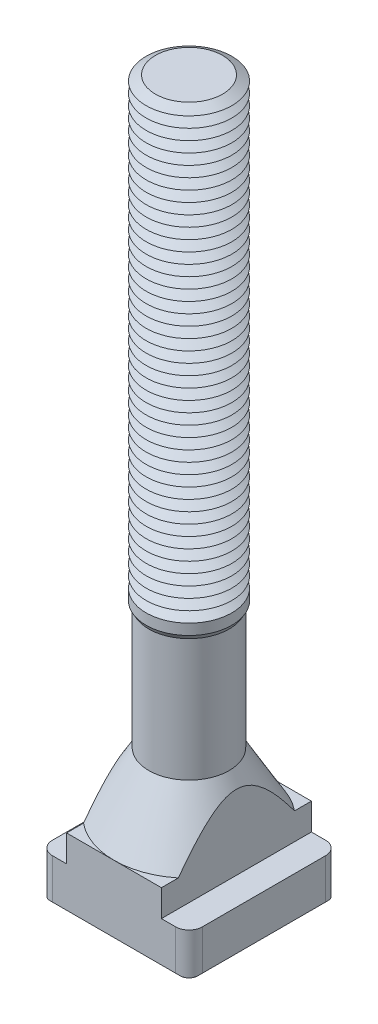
ISO-10303-21;
HEADER;
FILE_DESCRIPTION(('STEP AP214'),'2;1');
FILE_NAME('part.step','',(''),(''),'','','');
FILE_SCHEMA(('AUTOMOTIVE_DESIGN { 1 0 10303 214 1 1 1 1 }'));
ENDSEC;
DATA;
#1=APPLICATION_CONTEXT('core data for automotive mechanical design processes');
#2=APPLICATION_PROTOCOL_DEFINITION('international standard','automotive_design',2000,#1);
#3=PRODUCT_CONTEXT('',#1,'mechanical');
#4=PRODUCT('Part','Part','',(#3));
#5=PRODUCT_RELATED_PRODUCT_CATEGORY('part','',(#4));
#6=PRODUCT_DEFINITION_FORMATION('','',#4);
#7=PRODUCT_DEFINITION_CONTEXT('part definition',#1,'design');
#8=PRODUCT_DEFINITION('design','',#6,#7);
#9=PRODUCT_DEFINITION_SHAPE('','',#8);
#10=(LENGTH_UNIT() NAMED_UNIT(*) SI_UNIT(.MILLI.,.METRE.));
#11=(NAMED_UNIT(*) PLANE_ANGLE_UNIT() SI_UNIT($,.RADIAN.));
#12=(NAMED_UNIT(*) SI_UNIT($,.STERADIAN.) SOLID_ANGLE_UNIT());
#13=UNCERTAINTY_MEASURE_WITH_UNIT(LENGTH_MEASURE(1.E-05),#10,'distance_accuracy_value','');
#14=(GEOMETRIC_REPRESENTATION_CONTEXT(3) GLOBAL_UNCERTAINTY_ASSIGNED_CONTEXT((#13)) GLOBAL_UNIT_ASSIGNED_CONTEXT((#10,
#11,#12)) REPRESENTATION_CONTEXT('',''));
#15=CARTESIAN_POINT('',(0.,0.,0.));
#16=DIRECTION('',(0.,0.,1.));
#17=DIRECTION('',(1.,0.,0.));
#18=AXIS2_PLACEMENT_3D('',#15,#16,#17);
#19=CARTESIAN_POINT('',(0.,127.,0.));
#20=DIRECTION('',(0.,-1.,0.));
#21=DIRECTION('',(0.,0.,-1.));
#22=AXIS2_PLACEMENT_3D('',#19,#20,#21);
#23=CONICAL_SURFACE('',#22,6.26794919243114,1.0471975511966);
#24=CARTESIAN_POINT('',(0.,126.,0.));
#25=DIRECTION('',(0.,-1.,0.));
#26=DIRECTION('',(0.,0.,-1.));
#27=AXIS2_PLACEMENT_3D('',#24,#25,#26);
#28=CIRCLE('',#27,8.00000000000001);
#29=CARTESIAN_POINT('',(0.,126.,-8.00000000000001));
#30=VERTEX_POINT('',#29);
#31=EDGE_CURVE('E778',#30,#30,#28,.T.);
#32=ORIENTED_EDGE('',*,*,#31,.F.);
#33=EDGE_LOOP('',(#32));
#34=FACE_BOUND('',#33,.T.);
#35=CARTESIAN_POINT('',(0.,127.,0.));
#36=DIRECTION('',(0.,-1.,0.));
#37=DIRECTION('',(0.,0.,-1.));
#38=AXIS2_PLACEMENT_3D('',#35,#36,#37);
#39=CIRCLE('',#38,6.26794919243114);
#40=CARTESIAN_POINT('',(0.,127.,-6.26794919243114));
#41=VERTEX_POINT('',#40);
#42=EDGE_CURVE('E822',#41,#41,#39,.T.);
#43=ORIENTED_EDGE('',*,*,#42,.T.);
#44=EDGE_LOOP('',(#43));
#45=FACE_BOUND('',#44,.T.);
#46=ADVANCED_FACE('F39',(#34,#45),#23,.T.);
#47=CARTESIAN_POINT('',(0.,128.,0.));
#48=DIRECTION('',(0.,1.,0.));
#49=DIRECTION('',(0.,0.,1.));
#50=AXIS2_PLACEMENT_3D('',#47,#48,#49);
#51=CONICAL_SURFACE('',#50,8.00000000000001,1.0471975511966);
#52=ORIENTED_EDGE('',*,*,#42,.F.);
#53=EDGE_LOOP('',(#52));
#54=FACE_BOUND('',#53,.T.);
#55=CARTESIAN_POINT('',(0.,128.,0.));
#56=DIRECTION('',(0.,-1.,0.));
#57=DIRECTION('',(0.,0.,-1.));
#58=AXIS2_PLACEMENT_3D('',#55,#56,#57);
#59=CIRCLE('',#58,8.00000000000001);
#60=CARTESIAN_POINT('',(0.,128.,-8.00000000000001));
#61=VERTEX_POINT('',#60);
#62=EDGE_CURVE('E738',#61,#61,#59,.T.);
#63=ORIENTED_EDGE('',*,*,#62,.T.);
#64=EDGE_LOOP('',(#63));
#65=FACE_BOUND('',#64,.T.);
#66=ADVANCED_FACE('F449',(#54,#65),#51,.T.);
#67=CARTESIAN_POINT('',(3.83173198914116,135.,0.));
#68=DIRECTION('',(0.,-1.,0.));
#69=DIRECTION('',(1.,0.,0.));
#70=AXIS2_PLACEMENT_3D('',#67,#68,#69);
#71=PLANE('',#70);
#72=CARTESIAN_POINT('',(0.,135.,0.));
#73=DIRECTION('',(0.,-1.,0.));
#74=DIRECTION('',(0.,0.,-1.));
#75=AXIS2_PLACEMENT_3D('',#72,#73,#74);
#76=CIRCLE('',#75,6.26794919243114);
#77=CARTESIAN_POINT('',(0.,135.,-6.26794919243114));
#78=VERTEX_POINT('',#77);
#79=EDGE_CURVE('E662',#78,#78,#76,.T.);
#80=ORIENTED_EDGE('',*,*,#79,.F.);
#81=EDGE_LOOP('',(#80));
#82=FACE_BOUND('',#81,.T.);
#83=ADVANCED_FACE('F455',(#82),#71,.F.);
#84=CARTESIAN_POINT('',(0.,135.,0.));
#85=DIRECTION('',(0.,-1.,0.));
#86=DIRECTION('',(0.,0.,-1.));
#87=AXIS2_PLACEMENT_3D('',#84,#85,#86);
#88=CONICAL_SURFACE('',#87,6.26794919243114,1.0471975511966);
#89=CARTESIAN_POINT('',(0.,134.,0.));
#90=DIRECTION('',(0.,-1.,0.));
#91=DIRECTION('',(0.,0.,-1.));
#92=AXIS2_PLACEMENT_3D('',#89,#90,#91);
#93=CIRCLE('',#92,8.00000000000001);
#94=CARTESIAN_POINT('',(0.,134.,-8.00000000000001));
#95=VERTEX_POINT('',#94);
#96=EDGE_CURVE('E660',#95,#95,#93,.T.);
#97=ORIENTED_EDGE('',*,*,#96,.F.);
#98=EDGE_LOOP('',(#97));
#99=FACE_BOUND('',#98,.T.);
#100=ORIENTED_EDGE('',*,*,#79,.T.);
#101=EDGE_LOOP('',(#100));
#102=FACE_BOUND('',#101,.T.);
#103=ADVANCED_FACE('F483',(#99,#102),#88,.T.);
#104=CARTESIAN_POINT('',(0.,134.,0.));
#105=DIRECTION('',(0.,1.,0.));
#106=DIRECTION('',(0.,0.,1.));
#107=AXIS2_PLACEMENT_3D('',#104,#105,#106);
#108=CONICAL_SURFACE('',#107,8.00000000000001,1.0471975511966);
#109=CARTESIAN_POINT('',(0.,133.,0.));
#110=DIRECTION('',(0.,-1.,0.));
#111=DIRECTION('',(0.,0.,-1.));
#112=AXIS2_PLACEMENT_3D('',#109,#110,#111);
#113=CIRCLE('',#112,6.26794919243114);
#114=CARTESIAN_POINT('',(0.,133.,-6.26794919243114));
#115=VERTEX_POINT('',#114);
#116=EDGE_CURVE('E663',#115,#115,#113,.T.);
#117=ORIENTED_EDGE('',*,*,#116,.F.);
#118=EDGE_LOOP('',(#117));
#119=FACE_BOUND('',#118,.T.);
#120=ORIENTED_EDGE('',*,*,#96,.T.);
#121=EDGE_LOOP('',(#120));
#122=FACE_BOUND('',#121,.T.);
#123=ADVANCED_FACE('F480',(#119,#122),#108,.T.);
#124=CARTESIAN_POINT('',(0.,133.,0.));
#125=DIRECTION('',(0.,-1.,0.));
#126=DIRECTION('',(0.,0.,-1.));
#127=AXIS2_PLACEMENT_3D('',#124,#125,#126);
#128=CONICAL_SURFACE('',#127,6.26794919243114,1.0471975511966);
#129=CARTESIAN_POINT('',(0.,132.,0.));
#130=DIRECTION('',(0.,-1.,0.));
#131=DIRECTION('',(0.,0.,-1.));
#132=AXIS2_PLACEMENT_3D('',#129,#130,#131);
#133=CIRCLE('',#132,8.00000000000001);
#134=CARTESIAN_POINT('',(0.,132.,-8.00000000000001));
#135=VERTEX_POINT('',#134);
#136=EDGE_CURVE('E834',#135,#135,#133,.T.);
#137=ORIENTED_EDGE('',*,*,#136,.F.);
#138=EDGE_LOOP('',(#137));
#139=FACE_BOUND('',#138,.T.);
#140=ORIENTED_EDGE('',*,*,#116,.T.);
#141=EDGE_LOOP('',(#140));
#142=FACE_BOUND('',#141,.T.);
#143=ADVANCED_FACE('F475',(#139,#142),#128,.T.);
#144=CARTESIAN_POINT('',(0.,132.,0.));
#145=DIRECTION('',(0.,1.,0.));
#146=DIRECTION('',(0.,0.,1.));
#147=AXIS2_PLACEMENT_3D('',#144,#145,#146);
#148=CONICAL_SURFACE('',#147,8.00000000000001,1.0471975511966);
#149=CARTESIAN_POINT('',(0.,131.,0.));
#150=DIRECTION('',(0.,-1.,0.));
#151=DIRECTION('',(0.,0.,-1.));
#152=AXIS2_PLACEMENT_3D('',#149,#150,#151);
#153=CIRCLE('',#152,6.26794919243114);
#154=CARTESIAN_POINT('',(0.,131.,-6.26794919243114));
#155=VERTEX_POINT('',#154);
#156=EDGE_CURVE('E819',#155,#155,#153,.T.);
#157=ORIENTED_EDGE('',*,*,#156,.F.);
#158=EDGE_LOOP('',(#157));
#159=FACE_BOUND('',#158,.T.);
#160=ORIENTED_EDGE('',*,*,#136,.T.);
#161=EDGE_LOOP('',(#160));
#162=FACE_BOUND('',#161,.T.);
#163=ADVANCED_FACE('F472',(#159,#162),#148,.T.);
#164=CARTESIAN_POINT('',(0.,131.,0.));
#165=DIRECTION('',(0.,-1.,0.));
#166=DIRECTION('',(0.,0.,-1.));
#167=AXIS2_PLACEMENT_3D('',#164,#165,#166);
#168=CONICAL_SURFACE('',#167,6.26794919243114,1.0471975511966);
#169=CARTESIAN_POINT('',(0.,130.,0.));
#170=DIRECTION('',(0.,-1.,0.));
#171=DIRECTION('',(0.,0.,-1.));
#172=AXIS2_PLACEMENT_3D('',#169,#170,#171);
#173=CIRCLE('',#172,8.00000000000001);
#174=CARTESIAN_POINT('',(0.,130.,-8.00000000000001));
#175=VERTEX_POINT('',#174);
#176=EDGE_CURVE('E737',#175,#175,#173,.T.);
#177=ORIENTED_EDGE('',*,*,#176,.F.);
#178=EDGE_LOOP('',(#177));
#179=FACE_BOUND('',#178,.T.);
#180=ORIENTED_EDGE('',*,*,#156,.T.);
#181=EDGE_LOOP('',(#180));
#182=FACE_BOUND('',#181,.T.);
#183=ADVANCED_FACE('F466',(#179,#182),#168,.T.);
#184=CARTESIAN_POINT('',(0.,130.,0.));
#185=DIRECTION('',(0.,1.,0.));
#186=DIRECTION('',(0.,0.,1.));
#187=AXIS2_PLACEMENT_3D('',#184,#185,#186);
#188=CONICAL_SURFACE('',#187,8.00000000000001,1.0471975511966);
#189=CARTESIAN_POINT('',(0.,129.,0.));
#190=DIRECTION('',(0.,-1.,0.));
#191=DIRECTION('',(0.,0.,-1.));
#192=AXIS2_PLACEMENT_3D('',#189,#190,#191);
#193=CIRCLE('',#192,6.26794919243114);
#194=CARTESIAN_POINT('',(0.,129.,-6.26794919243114));
#195=VERTEX_POINT('',#194);
#196=EDGE_CURVE('E734',#195,#195,#193,.T.);
#197=ORIENTED_EDGE('',*,*,#196,.F.);
#198=EDGE_LOOP('',(#197));
#199=FACE_BOUND('',#198,.T.);
#200=ORIENTED_EDGE('',*,*,#176,.T.);
#201=EDGE_LOOP('',(#200));
#202=FACE_BOUND('',#201,.T.);
#203=ADVANCED_FACE('F462',(#199,#202),#188,.T.);
#204=CARTESIAN_POINT('',(0.,129.,0.));
#205=DIRECTION('',(0.,-1.,0.));
#206=DIRECTION('',(0.,0.,-1.));
#207=AXIS2_PLACEMENT_3D('',#204,#205,#206);
#208=CONICAL_SURFACE('',#207,6.26794919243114,1.0471975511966);
#209=ORIENTED_EDGE('',*,*,#62,.F.);
#210=EDGE_LOOP('',(#209));
#211=FACE_BOUND('',#210,.T.);
#212=ORIENTED_EDGE('',*,*,#196,.T.);
#213=EDGE_LOOP('',(#212));
#214=FACE_BOUND('',#213,.T.);
#215=ADVANCED_FACE('F465',(#211,#214),#208,.T.);
#216=CARTESIAN_POINT('',(0.,125.,0.));
#217=DIRECTION('',(0.,-1.,0.));
#218=DIRECTION('',(0.,0.,-1.));
#219=AXIS2_PLACEMENT_3D('',#216,#217,#218);
#220=CONICAL_SURFACE('',#219,6.26794919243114,1.0471975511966);
#221=CARTESIAN_POINT('',(0.,124.,0.));
#222=DIRECTION('',(0.,-1.,0.));
#223=DIRECTION('',(0.,0.,-1.));
#224=AXIS2_PLACEMENT_3D('',#221,#222,#223);
#225=CIRCLE('',#224,8.00000000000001);
#226=CARTESIAN_POINT('',(0.,124.,-8.00000000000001));
#227=VERTEX_POINT('',#226);
#228=EDGE_CURVE('E698',#227,#227,#225,.T.);
#229=ORIENTED_EDGE('',*,*,#228,.F.);
#230=EDGE_LOOP('',(#229));
#231=FACE_BOUND('',#230,.T.);
#232=CARTESIAN_POINT('',(0.,125.,0.));
#233=DIRECTION('',(0.,-1.,0.));
#234=DIRECTION('',(0.,0.,-1.));
#235=AXIS2_PLACEMENT_3D('',#232,#233,#234);
#236=CIRCLE('',#235,6.26794919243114);
#237=CARTESIAN_POINT('',(0.,125.,-6.26794919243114));
#238=VERTEX_POINT('',#237);
#239=EDGE_CURVE('E776',#238,#238,#236,.T.);
#240=ORIENTED_EDGE('',*,*,#239,.T.);
#241=EDGE_LOOP('',(#240));
#242=FACE_BOUND('',#241,.T.);
#243=ADVANCED_FACE('F470',(#231,#242),#220,.T.);
#244=CARTESIAN_POINT('',(0.,126.,0.));
#245=DIRECTION('',(0.,1.,0.));
#246=DIRECTION('',(0.,0.,1.));
#247=AXIS2_PLACEMENT_3D('',#244,#245,#246);
#248=CONICAL_SURFACE('',#247,8.00000000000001,1.0471975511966);
#249=ORIENTED_EDGE('',*,*,#239,.F.);
#250=EDGE_LOOP('',(#249));
#251=FACE_BOUND('',#250,.T.);
#252=ORIENTED_EDGE('',*,*,#31,.T.);
#253=EDGE_LOOP('',(#252));
#254=FACE_BOUND('',#253,.T.);
#255=ADVANCED_FACE('F998',(#251,#254),#248,.T.);
#256=CARTESIAN_POINT('',(0.,123.,0.));
#257=DIRECTION('',(0.,-1.,0.));
#258=DIRECTION('',(0.,0.,-1.));
#259=AXIS2_PLACEMENT_3D('',#256,#257,#258);
#260=CONICAL_SURFACE('',#259,6.26794919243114,1.0471975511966);
#261=CARTESIAN_POINT('',(0.,122.,0.));
#262=DIRECTION('',(0.,-1.,0.));
#263=DIRECTION('',(0.,0.,-1.));
#264=AXIS2_PLACEMENT_3D('',#261,#262,#263);
#265=CIRCLE('',#264,8.00000000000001);
#266=CARTESIAN_POINT('',(0.,122.,-8.00000000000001));
#267=VERTEX_POINT('',#266);
#268=EDGE_CURVE('E693',#267,#267,#265,.T.);
#269=ORIENTED_EDGE('',*,*,#268,.F.);
#270=EDGE_LOOP('',(#269));
#271=FACE_BOUND('',#270,.T.);
#272=CARTESIAN_POINT('',(0.,123.,0.));
#273=DIRECTION('',(0.,-1.,0.));
#274=DIRECTION('',(0.,0.,-1.));
#275=AXIS2_PLACEMENT_3D('',#272,#273,#274);
#276=CIRCLE('',#275,6.26794919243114);
#277=CARTESIAN_POINT('',(0.,123.,-6.26794919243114));
#278=VERTEX_POINT('',#277);
#279=EDGE_CURVE('E696',#278,#278,#276,.T.);
#280=ORIENTED_EDGE('',*,*,#279,.T.);
#281=EDGE_LOOP('',(#280));
#282=FACE_BOUND('',#281,.T.);
#283=ADVANCED_FACE('F1003',(#271,#282),#260,.T.);
#284=CARTESIAN_POINT('',(0.,124.,0.));
#285=DIRECTION('',(0.,1.,0.));
#286=DIRECTION('',(0.,0.,1.));
#287=AXIS2_PLACEMENT_3D('',#284,#285,#286);
#288=CONICAL_SURFACE('',#287,8.00000000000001,1.0471975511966);
#289=ORIENTED_EDGE('',*,*,#279,.F.);
#290=EDGE_LOOP('',(#289));
#291=FACE_BOUND('',#290,.T.);
#292=ORIENTED_EDGE('',*,*,#228,.T.);
#293=EDGE_LOOP('',(#292));
#294=FACE_BOUND('',#293,.T.);
#295=ADVANCED_FACE('F994',(#291,#294),#288,.T.);
#296=CARTESIAN_POINT('',(0.,121.,0.));
#297=DIRECTION('',(0.,-1.,0.));
#298=DIRECTION('',(0.,0.,-1.));
#299=AXIS2_PLACEMENT_3D('',#296,#297,#298);
#300=CONICAL_SURFACE('',#299,6.26794919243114,1.0471975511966);
#301=CARTESIAN_POINT('',(0.,120.,0.));
#302=DIRECTION('',(0.,-1.,0.));
#303=DIRECTION('',(0.,0.,-1.));
#304=AXIS2_PLACEMENT_3D('',#301,#302,#303);
#305=CIRCLE('',#304,8.00000000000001);
#306=CARTESIAN_POINT('',(0.,120.,-8.00000000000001));
#307=VERTEX_POINT('',#306);
#308=EDGE_CURVE('E694',#307,#307,#305,.T.);
#309=ORIENTED_EDGE('',*,*,#308,.F.);
#310=EDGE_LOOP('',(#309));
#311=FACE_BOUND('',#310,.T.);
#312=CARTESIAN_POINT('',(0.,121.,0.));
#313=DIRECTION('',(0.,-1.,0.));
#314=DIRECTION('',(0.,0.,-1.));
#315=AXIS2_PLACEMENT_3D('',#312,#313,#314);
#316=CIRCLE('',#315,6.26794919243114);
#317=CARTESIAN_POINT('',(0.,121.,-6.26794919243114));
#318=VERTEX_POINT('',#317);
#319=EDGE_CURVE('E690',#318,#318,#316,.T.);
#320=ORIENTED_EDGE('',*,*,#319,.T.);
#321=EDGE_LOOP('',(#320));
#322=FACE_BOUND('',#321,.T.);
#323=ADVANCED_FACE('F1013',(#311,#322),#300,.T.);
#324=CARTESIAN_POINT('',(0.,122.,0.));
#325=DIRECTION('',(0.,1.,0.));
#326=DIRECTION('',(0.,0.,1.));
#327=AXIS2_PLACEMENT_3D('',#324,#325,#326);
#328=CONICAL_SURFACE('',#327,8.00000000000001,1.0471975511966);
#329=ORIENTED_EDGE('',*,*,#319,.F.);
#330=EDGE_LOOP('',(#329));
#331=FACE_BOUND('',#330,.T.);
#332=ORIENTED_EDGE('',*,*,#268,.T.);
#333=EDGE_LOOP('',(#332));
#334=FACE_BOUND('',#333,.T.);
#335=ADVANCED_FACE('F1017',(#331,#334),#328,.T.);
#336=CARTESIAN_POINT('',(0.,119.,0.));
#337=DIRECTION('',(0.,-1.,0.));
#338=DIRECTION('',(0.,0.,-1.));
#339=AXIS2_PLACEMENT_3D('',#336,#337,#338);
#340=CONICAL_SURFACE('',#339,6.26794919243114,1.0471975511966);
#341=CARTESIAN_POINT('',(0.,118.,0.));
#342=DIRECTION('',(0.,-1.,0.));
#343=DIRECTION('',(0.,0.,-1.));
#344=AXIS2_PLACEMENT_3D('',#341,#342,#343);
#345=CIRCLE('',#344,8.00000000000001);
#346=CARTESIAN_POINT('',(0.,118.,-8.00000000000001));
#347=VERTEX_POINT('',#346);
#348=EDGE_CURVE('E980',#347,#347,#345,.T.);
#349=ORIENTED_EDGE('',*,*,#348,.F.);
#350=EDGE_LOOP('',(#349));
#351=FACE_BOUND('',#350,.T.);
#352=CARTESIAN_POINT('',(0.,119.,0.));
#353=DIRECTION('',(0.,-1.,0.));
#354=DIRECTION('',(0.,0.,-1.));
#355=AXIS2_PLACEMENT_3D('',#352,#353,#354);
#356=CIRCLE('',#355,6.26794919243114);
#357=CARTESIAN_POINT('',(0.,119.,-6.26794919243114));
#358=VERTEX_POINT('',#357);
#359=EDGE_CURVE('E984',#358,#358,#356,.T.);
#360=ORIENTED_EDGE('',*,*,#359,.T.);
#361=EDGE_LOOP('',(#360));
#362=FACE_BOUND('',#361,.T.);
#363=ADVANCED_FACE('F1021',(#351,#362),#340,.T.);
#364=CARTESIAN_POINT('',(0.,120.,0.));
#365=DIRECTION('',(0.,1.,0.));
#366=DIRECTION('',(0.,0.,1.));
#367=AXIS2_PLACEMENT_3D('',#364,#365,#366);
#368=CONICAL_SURFACE('',#367,8.00000000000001,1.0471975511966);
#369=ORIENTED_EDGE('',*,*,#359,.F.);
#370=EDGE_LOOP('',(#369));
#371=FACE_BOUND('',#370,.T.);
#372=ORIENTED_EDGE('',*,*,#308,.T.);
#373=EDGE_LOOP('',(#372));
#374=FACE_BOUND('',#373,.T.);
#375=ADVANCED_FACE('F1025',(#371,#374),#368,.T.);
#376=CARTESIAN_POINT('',(0.,117.,0.));
#377=DIRECTION('',(0.,-1.,0.));
#378=DIRECTION('',(0.,0.,-1.));
#379=AXIS2_PLACEMENT_3D('',#376,#377,#378);
#380=CONICAL_SURFACE('',#379,6.26794919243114,1.0471975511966);
#381=CARTESIAN_POINT('',(0.,116.,0.));
#382=DIRECTION('',(0.,-1.,0.));
#383=DIRECTION('',(0.,0.,-1.));
#384=AXIS2_PLACEMENT_3D('',#381,#382,#383);
#385=CIRCLE('',#384,8.00000000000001);
#386=CARTESIAN_POINT('',(0.,116.,-8.00000000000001));
#387=VERTEX_POINT('',#386);
#388=EDGE_CURVE('E972',#387,#387,#385,.T.);
#389=ORIENTED_EDGE('',*,*,#388,.F.);
#390=EDGE_LOOP('',(#389));
#391=FACE_BOUND('',#390,.T.);
#392=CARTESIAN_POINT('',(0.,117.,0.));
#393=DIRECTION('',(0.,-1.,0.));
#394=DIRECTION('',(0.,0.,-1.));
#395=AXIS2_PLACEMENT_3D('',#392,#393,#394);
#396=CIRCLE('',#395,6.26794919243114);
#397=CARTESIAN_POINT('',(0.,117.,-6.26794919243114));
#398=VERTEX_POINT('',#397);
#399=EDGE_CURVE('E976',#398,#398,#396,.T.);
#400=ORIENTED_EDGE('',*,*,#399,.T.);
#401=EDGE_LOOP('',(#400));
#402=FACE_BOUND('',#401,.T.);
#403=ADVANCED_FACE('F1029',(#391,#402),#380,.T.);
#404=CARTESIAN_POINT('',(0.,118.,0.));
#405=DIRECTION('',(0.,1.,0.));
#406=DIRECTION('',(0.,0.,1.));
#407=AXIS2_PLACEMENT_3D('',#404,#405,#406);
#408=CONICAL_SURFACE('',#407,8.00000000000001,1.0471975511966);
#409=ORIENTED_EDGE('',*,*,#399,.F.);
#410=EDGE_LOOP('',(#409));
#411=FACE_BOUND('',#410,.T.);
#412=ORIENTED_EDGE('',*,*,#348,.T.);
#413=EDGE_LOOP('',(#412));
#414=FACE_BOUND('',#413,.T.);
#415=ADVANCED_FACE('F1033',(#411,#414),#408,.T.);
#416=CARTESIAN_POINT('',(0.,115.,0.));
#417=DIRECTION('',(0.,-1.,0.));
#418=DIRECTION('',(0.,0.,-1.));
#419=AXIS2_PLACEMENT_3D('',#416,#417,#418);
#420=CONICAL_SURFACE('',#419,6.26794919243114,1.0471975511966);
#421=CARTESIAN_POINT('',(0.,114.,0.));
#422=DIRECTION('',(0.,-1.,0.));
#423=DIRECTION('',(0.,0.,-1.));
#424=AXIS2_PLACEMENT_3D('',#421,#422,#423);
#425=CIRCLE('',#424,8.00000000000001);
#426=CARTESIAN_POINT('',(0.,114.,-8.00000000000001));
#427=VERTEX_POINT('',#426);
#428=EDGE_CURVE('E802',#427,#427,#425,.T.);
#429=ORIENTED_EDGE('',*,*,#428,.F.);
#430=EDGE_LOOP('',(#429));
#431=FACE_BOUND('',#430,.T.);
#432=CARTESIAN_POINT('',(0.,115.,0.));
#433=DIRECTION('',(0.,-1.,0.));
#434=DIRECTION('',(0.,0.,-1.));
#435=AXIS2_PLACEMENT_3D('',#432,#433,#434);
#436=CIRCLE('',#435,6.26794919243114);
#437=CARTESIAN_POINT('',(0.,115.,-6.26794919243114));
#438=VERTEX_POINT('',#437);
#439=EDGE_CURVE('E861',#438,#438,#436,.T.);
#440=ORIENTED_EDGE('',*,*,#439,.T.);
#441=EDGE_LOOP('',(#440));
#442=FACE_BOUND('',#441,.T.);
#443=ADVANCED_FACE('F1037',(#431,#442),#420,.T.);
#444=CARTESIAN_POINT('',(0.,116.,0.));
#445=DIRECTION('',(0.,1.,0.));
#446=DIRECTION('',(0.,0.,1.));
#447=AXIS2_PLACEMENT_3D('',#444,#445,#446);
#448=CONICAL_SURFACE('',#447,8.00000000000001,1.0471975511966);
#449=ORIENTED_EDGE('',*,*,#439,.F.);
#450=EDGE_LOOP('',(#449));
#451=FACE_BOUND('',#450,.T.);
#452=ORIENTED_EDGE('',*,*,#388,.T.);
#453=EDGE_LOOP('',(#452));
#454=FACE_BOUND('',#453,.T.);
#455=ADVANCED_FACE('F1041',(#451,#454),#448,.T.);
#456=CARTESIAN_POINT('',(0.,113.,0.));
#457=DIRECTION('',(0.,-1.,0.));
#458=DIRECTION('',(0.,0.,-1.));
#459=AXIS2_PLACEMENT_3D('',#456,#457,#458);
#460=CONICAL_SURFACE('',#459,6.26794919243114,1.0471975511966);
#461=CARTESIAN_POINT('',(0.,112.,0.));
#462=DIRECTION('',(0.,-1.,0.));
#463=DIRECTION('',(0.,0.,-1.));
#464=AXIS2_PLACEMENT_3D('',#461,#462,#463);
#465=CIRCLE('',#464,8.00000000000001);
#466=CARTESIAN_POINT('',(0.,112.,-8.00000000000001));
#467=VERTEX_POINT('',#466);
#468=EDGE_CURVE('E654',#467,#467,#465,.T.);
#469=ORIENTED_EDGE('',*,*,#468,.F.);
#470=EDGE_LOOP('',(#469));
#471=FACE_BOUND('',#470,.T.);
#472=CARTESIAN_POINT('',(0.,113.,0.));
#473=DIRECTION('',(0.,-1.,0.));
#474=DIRECTION('',(0.,0.,-1.));
#475=AXIS2_PLACEMENT_3D('',#472,#473,#474);
#476=CIRCLE('',#475,6.26794919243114);
#477=CARTESIAN_POINT('',(0.,113.,-6.26794919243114));
#478=VERTEX_POINT('',#477);
#479=EDGE_CURVE('E657',#478,#478,#476,.T.);
#480=ORIENTED_EDGE('',*,*,#479,.T.);
#481=EDGE_LOOP('',(#480));
#482=FACE_BOUND('',#481,.T.);
#483=ADVANCED_FACE('F1045',(#471,#482),#460,.T.);
#484=CARTESIAN_POINT('',(0.,114.,0.));
#485=DIRECTION('',(0.,1.,0.));
#486=DIRECTION('',(0.,0.,1.));
#487=AXIS2_PLACEMENT_3D('',#484,#485,#486);
#488=CONICAL_SURFACE('',#487,8.00000000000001,1.0471975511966);
#489=ORIENTED_EDGE('',*,*,#479,.F.);
#490=EDGE_LOOP('',(#489));
#491=FACE_BOUND('',#490,.T.);
#492=ORIENTED_EDGE('',*,*,#428,.T.);
#493=EDGE_LOOP('',(#492));
#494=FACE_BOUND('',#493,.T.);
#495=ADVANCED_FACE('F1049',(#491,#494),#488,.T.);
#496=CARTESIAN_POINT('',(0.,111.,0.));
#497=DIRECTION('',(0.,-1.,0.));
#498=DIRECTION('',(0.,0.,-1.));
#499=AXIS2_PLACEMENT_3D('',#496,#497,#498);
#500=CONICAL_SURFACE('',#499,6.26794919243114,1.0471975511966);
#501=CARTESIAN_POINT('',(0.,110.,0.));
#502=DIRECTION('',(0.,-1.,0.));
#503=DIRECTION('',(0.,0.,-1.));
#504=AXIS2_PLACEMENT_3D('',#501,#502,#503);
#505=CIRCLE('',#504,8.00000000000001);
#506=CARTESIAN_POINT('',(0.,110.,-8.00000000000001));
#507=VERTEX_POINT('',#506);
#508=EDGE_CURVE('E712',#507,#507,#505,.T.);
#509=ORIENTED_EDGE('',*,*,#508,.F.);
#510=EDGE_LOOP('',(#509));
#511=FACE_BOUND('',#510,.T.);
#512=CARTESIAN_POINT('',(0.,111.,0.));
#513=DIRECTION('',(0.,-1.,0.));
#514=DIRECTION('',(0.,0.,-1.));
#515=AXIS2_PLACEMENT_3D('',#512,#513,#514);
#516=CIRCLE('',#515,6.26794919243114);
#517=CARTESIAN_POINT('',(0.,111.,-6.26794919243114));
#518=VERTEX_POINT('',#517);
#519=EDGE_CURVE('E658',#518,#518,#516,.T.);
#520=ORIENTED_EDGE('',*,*,#519,.T.);
#521=EDGE_LOOP('',(#520));
#522=FACE_BOUND('',#521,.T.);
#523=ADVANCED_FACE('F1053',(#511,#522),#500,.T.);
#524=CARTESIAN_POINT('',(0.,112.,0.));
#525=DIRECTION('',(0.,1.,0.));
#526=DIRECTION('',(0.,0.,1.));
#527=AXIS2_PLACEMENT_3D('',#524,#525,#526);
#528=CONICAL_SURFACE('',#527,8.00000000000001,1.0471975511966);
#529=ORIENTED_EDGE('',*,*,#519,.F.);
#530=EDGE_LOOP('',(#529));
#531=FACE_BOUND('',#530,.T.);
#532=ORIENTED_EDGE('',*,*,#468,.T.);
#533=EDGE_LOOP('',(#532));
#534=FACE_BOUND('',#533,.T.);
#535=ADVANCED_FACE('F1057',(#531,#534),#528,.T.);
#536=CARTESIAN_POINT('',(0.,109.,0.));
#537=DIRECTION('',(0.,-1.,0.));
#538=DIRECTION('',(0.,0.,-1.));
#539=AXIS2_PLACEMENT_3D('',#536,#537,#538);
#540=CONICAL_SURFACE('',#539,6.26794919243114,1.0471975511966);
#541=CARTESIAN_POINT('',(0.,108.,0.));
#542=DIRECTION('',(0.,-1.,0.));
#543=DIRECTION('',(0.,0.,-1.));
#544=AXIS2_PLACEMENT_3D('',#541,#542,#543);
#545=CIRCLE('',#544,8.00000000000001);
#546=CARTESIAN_POINT('',(0.,108.,-8.00000000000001));
#547=VERTEX_POINT('',#546);
#548=EDGE_CURVE('E732',#547,#547,#545,.T.);
#549=ORIENTED_EDGE('',*,*,#548,.F.);
#550=EDGE_LOOP('',(#549));
#551=FACE_BOUND('',#550,.T.);
#552=CARTESIAN_POINT('',(0.,109.,0.));
#553=DIRECTION('',(0.,-1.,0.));
#554=DIRECTION('',(0.,0.,-1.));
#555=AXIS2_PLACEMENT_3D('',#552,#553,#554);
#556=CIRCLE('',#555,6.26794919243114);
#557=CARTESIAN_POINT('',(0.,109.,-6.26794919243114));
#558=VERTEX_POINT('',#557);
#559=EDGE_CURVE('E715',#558,#558,#556,.T.);
#560=ORIENTED_EDGE('',*,*,#559,.T.);
#561=EDGE_LOOP('',(#560));
#562=FACE_BOUND('',#561,.T.);
#563=ADVANCED_FACE('F1061',(#551,#562),#540,.T.);
#564=CARTESIAN_POINT('',(0.,110.,0.));
#565=DIRECTION('',(0.,1.,0.));
#566=DIRECTION('',(0.,0.,1.));
#567=AXIS2_PLACEMENT_3D('',#564,#565,#566);
#568=CONICAL_SURFACE('',#567,8.00000000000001,1.0471975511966);
#569=ORIENTED_EDGE('',*,*,#559,.F.);
#570=EDGE_LOOP('',(#569));
#571=FACE_BOUND('',#570,.T.);
#572=ORIENTED_EDGE('',*,*,#508,.T.);
#573=EDGE_LOOP('',(#572));
#574=FACE_BOUND('',#573,.T.);
#575=ADVANCED_FACE('F1065',(#571,#574),#568,.T.);
#576=CARTESIAN_POINT('',(0.,107.,0.));
#577=DIRECTION('',(0.,-1.,0.));
#578=DIRECTION('',(0.,0.,-1.));
#579=AXIS2_PLACEMENT_3D('',#576,#577,#578);
#580=CONICAL_SURFACE('',#579,6.26794919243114,1.0471975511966);
#581=CARTESIAN_POINT('',(0.,106.,0.));
#582=DIRECTION('',(0.,-1.,0.));
#583=DIRECTION('',(0.,0.,-1.));
#584=AXIS2_PLACEMENT_3D('',#581,#582,#583);
#585=CIRCLE('',#584,8.00000000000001);
#586=CARTESIAN_POINT('',(0.,106.,-8.00000000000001));
#587=VERTEX_POINT('',#586);
#588=EDGE_CURVE('E648',#587,#587,#585,.T.);
#589=ORIENTED_EDGE('',*,*,#588,.F.);
#590=EDGE_LOOP('',(#589));
#591=FACE_BOUND('',#590,.T.);
#592=CARTESIAN_POINT('',(0.,107.,0.));
#593=DIRECTION('',(0.,-1.,0.));
#594=DIRECTION('',(0.,0.,-1.));
#595=AXIS2_PLACEMENT_3D('',#592,#593,#594);
#596=CIRCLE('',#595,6.26794919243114);
#597=CARTESIAN_POINT('',(0.,107.,-6.26794919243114));
#598=VERTEX_POINT('',#597);
#599=EDGE_CURVE('E651',#598,#598,#596,.T.);
#600=ORIENTED_EDGE('',*,*,#599,.T.);
#601=EDGE_LOOP('',(#600));
#602=FACE_BOUND('',#601,.T.);
#603=ADVANCED_FACE('F1069',(#591,#602),#580,.T.);
#604=CARTESIAN_POINT('',(0.,108.,0.));
#605=DIRECTION('',(0.,1.,0.));
#606=DIRECTION('',(0.,0.,1.));
#607=AXIS2_PLACEMENT_3D('',#604,#605,#606);
#608=CONICAL_SURFACE('',#607,8.00000000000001,1.0471975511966);
#609=ORIENTED_EDGE('',*,*,#599,.F.);
#610=EDGE_LOOP('',(#609));
#611=FACE_BOUND('',#610,.T.);
#612=ORIENTED_EDGE('',*,*,#548,.T.);
#613=EDGE_LOOP('',(#612));
#614=FACE_BOUND('',#613,.T.);
#615=ADVANCED_FACE('F1073',(#611,#614),#608,.T.);
#616=CARTESIAN_POINT('',(0.,105.,0.));
#617=DIRECTION('',(0.,-1.,0.));
#618=DIRECTION('',(0.,0.,-1.));
#619=AXIS2_PLACEMENT_3D('',#616,#617,#618);
#620=CONICAL_SURFACE('',#619,6.26794919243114,1.0471975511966);
#621=CARTESIAN_POINT('',(0.,104.,0.));
#622=DIRECTION('',(0.,-1.,0.));
#623=DIRECTION('',(0.,0.,-1.));
#624=AXIS2_PLACEMENT_3D('',#621,#622,#623);
#625=CIRCLE('',#624,8.00000000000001);
#626=CARTESIAN_POINT('',(0.,104.,-8.00000000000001));
#627=VERTEX_POINT('',#626);
#628=EDGE_CURVE('E728',#627,#627,#625,.T.);
#629=ORIENTED_EDGE('',*,*,#628,.F.);
#630=EDGE_LOOP('',(#629));
#631=FACE_BOUND('',#630,.T.);
#632=CARTESIAN_POINT('',(0.,105.,0.));
#633=DIRECTION('',(0.,-1.,0.));
#634=DIRECTION('',(0.,0.,-1.));
#635=AXIS2_PLACEMENT_3D('',#632,#633,#634);
#636=CIRCLE('',#635,6.26794919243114);
#637=CARTESIAN_POINT('',(0.,105.,-6.26794919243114));
#638=VERTEX_POINT('',#637);
#639=EDGE_CURVE('E652',#638,#638,#636,.T.);
#640=ORIENTED_EDGE('',*,*,#639,.T.);
#641=EDGE_LOOP('',(#640));
#642=FACE_BOUND('',#641,.T.);
#643=ADVANCED_FACE('F1077',(#631,#642),#620,.T.);
#644=CARTESIAN_POINT('',(0.,106.,0.));
#645=DIRECTION('',(0.,1.,0.));
#646=DIRECTION('',(0.,0.,1.));
#647=AXIS2_PLACEMENT_3D('',#644,#645,#646);
#648=CONICAL_SURFACE('',#647,8.00000000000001,1.0471975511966);
#649=ORIENTED_EDGE('',*,*,#639,.F.);
#650=EDGE_LOOP('',(#649));
#651=FACE_BOUND('',#650,.T.);
#652=ORIENTED_EDGE('',*,*,#588,.T.);
#653=EDGE_LOOP('',(#652));
#654=FACE_BOUND('',#653,.T.);
#655=ADVANCED_FACE('F1081',(#651,#654),#648,.T.);
#656=CARTESIAN_POINT('',(0.,103.,0.));
#657=DIRECTION('',(0.,-1.,0.));
#658=DIRECTION('',(0.,0.,-1.));
#659=AXIS2_PLACEMENT_3D('',#656,#657,#658);
#660=CONICAL_SURFACE('',#659,6.26794919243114,1.0471975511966);
#661=CARTESIAN_POINT('',(0.,102.,0.));
#662=DIRECTION('',(0.,-1.,0.));
#663=DIRECTION('',(0.,0.,-1.));
#664=AXIS2_PLACEMENT_3D('',#661,#662,#663);
#665=CIRCLE('',#664,8.00000000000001);
#666=CARTESIAN_POINT('',(0.,102.,-8.00000000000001));
#667=VERTEX_POINT('',#666);
#668=EDGE_CURVE('E710',#667,#667,#665,.T.);
#669=ORIENTED_EDGE('',*,*,#668,.F.);
#670=EDGE_LOOP('',(#669));
#671=FACE_BOUND('',#670,.T.);
#672=CARTESIAN_POINT('',(0.,103.,0.));
#673=DIRECTION('',(0.,-1.,0.));
#674=DIRECTION('',(0.,0.,-1.));
#675=AXIS2_PLACEMENT_3D('',#672,#673,#674);
#676=CIRCLE('',#675,6.26794919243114);
#677=CARTESIAN_POINT('',(0.,103.,-6.26794919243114));
#678=VERTEX_POINT('',#677);
#679=EDGE_CURVE('E725',#678,#678,#676,.T.);
#680=ORIENTED_EDGE('',*,*,#679,.T.);
#681=EDGE_LOOP('',(#680));
#682=FACE_BOUND('',#681,.T.);
#683=ADVANCED_FACE('F1085',(#671,#682),#660,.T.);
#684=CARTESIAN_POINT('',(0.,104.,0.));
#685=DIRECTION('',(0.,1.,0.));
#686=DIRECTION('',(0.,0.,1.));
#687=AXIS2_PLACEMENT_3D('',#684,#685,#686);
#688=CONICAL_SURFACE('',#687,8.00000000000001,1.0471975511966);
#689=ORIENTED_EDGE('',*,*,#679,.F.);
#690=EDGE_LOOP('',(#689));
#691=FACE_BOUND('',#690,.T.);
#692=ORIENTED_EDGE('',*,*,#628,.T.);
#693=EDGE_LOOP('',(#692));
#694=FACE_BOUND('',#693,.T.);
#695=ADVANCED_FACE('F1089',(#691,#694),#688,.T.);
#696=CARTESIAN_POINT('',(0.,101.,0.));
#697=DIRECTION('',(0.,-1.,0.));
#698=DIRECTION('',(0.,0.,-1.));
#699=AXIS2_PLACEMENT_3D('',#696,#697,#698);
#700=CONICAL_SURFACE('',#699,6.26794919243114,1.0471975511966);
#701=CARTESIAN_POINT('',(0.,100.,0.));
#702=DIRECTION('',(0.,-1.,0.));
#703=DIRECTION('',(0.,0.,-1.));
#704=AXIS2_PLACEMENT_3D('',#701,#702,#703);
#705=CIRCLE('',#704,8.00000000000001);
#706=CARTESIAN_POINT('',(0.,100.,-8.00000000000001));
#707=VERTEX_POINT('',#706);
#708=EDGE_CURVE('E687',#707,#707,#705,.T.);
#709=ORIENTED_EDGE('',*,*,#708,.F.);
#710=EDGE_LOOP('',(#709));
#711=FACE_BOUND('',#710,.T.);
#712=CARTESIAN_POINT('',(0.,101.,0.));
#713=DIRECTION('',(0.,-1.,0.));
#714=DIRECTION('',(0.,0.,-1.));
#715=AXIS2_PLACEMENT_3D('',#712,#713,#714);
#716=CIRCLE('',#715,6.26794919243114);
#717=CARTESIAN_POINT('',(0.,101.,-6.26794919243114));
#718=VERTEX_POINT('',#717);
#719=EDGE_CURVE('E707',#718,#718,#716,.T.);
#720=ORIENTED_EDGE('',*,*,#719,.T.);
#721=EDGE_LOOP('',(#720));
#722=FACE_BOUND('',#721,.T.);
#723=ADVANCED_FACE('F1093',(#711,#722),#700,.T.);
#724=CARTESIAN_POINT('',(0.,102.,0.));
#725=DIRECTION('',(0.,1.,0.));
#726=DIRECTION('',(0.,0.,1.));
#727=AXIS2_PLACEMENT_3D('',#724,#725,#726);
#728=CONICAL_SURFACE('',#727,8.00000000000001,1.0471975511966);
#729=ORIENTED_EDGE('',*,*,#719,.F.);
#730=EDGE_LOOP('',(#729));
#731=FACE_BOUND('',#730,.T.);
#732=ORIENTED_EDGE('',*,*,#668,.T.);
#733=EDGE_LOOP('',(#732));
#734=FACE_BOUND('',#733,.T.);
#735=ADVANCED_FACE('F1097',(#731,#734),#728,.T.);
#736=CARTESIAN_POINT('',(0.,99.,0.));
#737=DIRECTION('',(0.,-1.,0.));
#738=DIRECTION('',(0.,0.,-1.));
#739=AXIS2_PLACEMENT_3D('',#736,#737,#738);
#740=CONICAL_SURFACE('',#739,6.26794919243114,1.0471975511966);
#741=CARTESIAN_POINT('',(0.,98.,0.));
#742=DIRECTION('',(0.,-1.,0.));
#743=DIRECTION('',(0.,0.,-1.));
#744=AXIS2_PLACEMENT_3D('',#741,#742,#743);
#745=CIRCLE('',#744,8.00000000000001);
#746=CARTESIAN_POINT('',(0.,98.,-8.00000000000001));
#747=VERTEX_POINT('',#746);
#748=EDGE_CURVE('E688',#747,#747,#745,.T.);
#749=ORIENTED_EDGE('',*,*,#748,.F.);
#750=EDGE_LOOP('',(#749));
#751=FACE_BOUND('',#750,.T.);
#752=CARTESIAN_POINT('',(0.,99.,0.));
#753=DIRECTION('',(0.,-1.,0.));
#754=DIRECTION('',(0.,0.,-1.));
#755=AXIS2_PLACEMENT_3D('',#752,#753,#754);
#756=CIRCLE('',#755,6.26794919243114);
#757=CARTESIAN_POINT('',(0.,99.,-6.26794919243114));
#758=VERTEX_POINT('',#757);
#759=EDGE_CURVE('E684',#758,#758,#756,.T.);
#760=ORIENTED_EDGE('',*,*,#759,.T.);
#761=EDGE_LOOP('',(#760));
#762=FACE_BOUND('',#761,.T.);
#763=ADVANCED_FACE('F1101',(#751,#762),#740,.T.);
#764=CARTESIAN_POINT('',(0.,100.,0.));
#765=DIRECTION('',(0.,1.,0.));
#766=DIRECTION('',(0.,0.,1.));
#767=AXIS2_PLACEMENT_3D('',#764,#765,#766);
#768=CONICAL_SURFACE('',#767,8.00000000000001,1.0471975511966);
#769=ORIENTED_EDGE('',*,*,#759,.F.);
#770=EDGE_LOOP('',(#769));
#771=FACE_BOUND('',#770,.T.);
#772=ORIENTED_EDGE('',*,*,#708,.T.);
#773=EDGE_LOOP('',(#772));
#774=FACE_BOUND('',#773,.T.);
#775=ADVANCED_FACE('F1105',(#771,#774),#768,.T.);
#776=CARTESIAN_POINT('',(0.,97.,0.));
#777=DIRECTION('',(0.,-1.,0.));
#778=DIRECTION('',(0.,0.,-1.));
#779=AXIS2_PLACEMENT_3D('',#776,#777,#778);
#780=CONICAL_SURFACE('',#779,6.26794919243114,1.0471975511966);
#781=CARTESIAN_POINT('',(0.,96.,0.));
#782=DIRECTION('',(0.,-1.,0.));
#783=DIRECTION('',(0.,0.,-1.));
#784=AXIS2_PLACEMENT_3D('',#781,#782,#783);
#785=CIRCLE('',#784,8.00000000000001);
#786=CARTESIAN_POINT('',(0.,96.,-8.00000000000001));
#787=VERTEX_POINT('',#786);
#788=EDGE_CURVE('E948',#787,#787,#785,.T.);
#789=ORIENTED_EDGE('',*,*,#788,.F.);
#790=EDGE_LOOP('',(#789));
#791=FACE_BOUND('',#790,.T.);
#792=CARTESIAN_POINT('',(0.,97.,0.));
#793=DIRECTION('',(0.,-1.,0.));
#794=DIRECTION('',(0.,0.,-1.));
#795=AXIS2_PLACEMENT_3D('',#792,#793,#794);
#796=CIRCLE('',#795,6.26794919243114);
#797=CARTESIAN_POINT('',(0.,97.,-6.26794919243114));
#798=VERTEX_POINT('',#797);
#799=EDGE_CURVE('E771',#798,#798,#796,.T.);
#800=ORIENTED_EDGE('',*,*,#799,.T.);
#801=EDGE_LOOP('',(#800));
#802=FACE_BOUND('',#801,.T.);
#803=ADVANCED_FACE('F1109',(#791,#802),#780,.T.);
#804=CARTESIAN_POINT('',(0.,98.,0.));
#805=DIRECTION('',(0.,1.,0.));
#806=DIRECTION('',(0.,0.,1.));
#807=AXIS2_PLACEMENT_3D('',#804,#805,#806);
#808=CONICAL_SURFACE('',#807,8.00000000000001,1.0471975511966);
#809=ORIENTED_EDGE('',*,*,#799,.F.);
#810=EDGE_LOOP('',(#809));
#811=FACE_BOUND('',#810,.T.);
#812=ORIENTED_EDGE('',*,*,#748,.T.);
#813=EDGE_LOOP('',(#812));
#814=FACE_BOUND('',#813,.T.);
#815=ADVANCED_FACE('F1113',(#811,#814),#808,.T.);
#816=CARTESIAN_POINT('',(0.,95.,0.));
#817=DIRECTION('',(0.,-1.,0.));
#818=DIRECTION('',(0.,0.,-1.));
#819=AXIS2_PLACEMENT_3D('',#816,#817,#818);
#820=CONICAL_SURFACE('',#819,6.26794919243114,1.0471975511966);
#821=CARTESIAN_POINT('',(0.,94.,0.));
#822=DIRECTION('',(0.,-1.,0.));
#823=DIRECTION('',(0.,0.,-1.));
#824=AXIS2_PLACEMENT_3D('',#821,#822,#823);
#825=CIRCLE('',#824,8.00000000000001);
#826=CARTESIAN_POINT('',(0.,94.,-8.00000000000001));
#827=VERTEX_POINT('',#826);
#828=EDGE_CURVE('E681',#827,#827,#825,.T.);
#829=ORIENTED_EDGE('',*,*,#828,.F.);
#830=EDGE_LOOP('',(#829));
#831=FACE_BOUND('',#830,.T.);
#832=CARTESIAN_POINT('',(0.,95.,0.));
#833=DIRECTION('',(0.,-1.,0.));
#834=DIRECTION('',(0.,0.,-1.));
#835=AXIS2_PLACEMENT_3D('',#832,#833,#834);
#836=CIRCLE('',#835,6.26794919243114);
#837=CARTESIAN_POINT('',(0.,95.,-6.26794919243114));
#838=VERTEX_POINT('',#837);
#839=EDGE_CURVE('E944',#838,#838,#836,.T.);
#840=ORIENTED_EDGE('',*,*,#839,.T.);
#841=EDGE_LOOP('',(#840));
#842=FACE_BOUND('',#841,.T.);
#843=ADVANCED_FACE('F1117',(#831,#842),#820,.T.);
#844=CARTESIAN_POINT('',(0.,96.,0.));
#845=DIRECTION('',(0.,1.,0.));
#846=DIRECTION('',(0.,0.,1.));
#847=AXIS2_PLACEMENT_3D('',#844,#845,#846);
#848=CONICAL_SURFACE('',#847,8.00000000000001,1.0471975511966);
#849=ORIENTED_EDGE('',*,*,#839,.F.);
#850=EDGE_LOOP('',(#849));
#851=FACE_BOUND('',#850,.T.);
#852=ORIENTED_EDGE('',*,*,#788,.T.);
#853=EDGE_LOOP('',(#852));
#854=FACE_BOUND('',#853,.T.);
#855=ADVANCED_FACE('F1121',(#851,#854),#848,.T.);
#856=CARTESIAN_POINT('',(0.,93.,0.));
#857=DIRECTION('',(0.,-1.,0.));
#858=DIRECTION('',(0.,0.,-1.));
#859=AXIS2_PLACEMENT_3D('',#856,#857,#858);
#860=CONICAL_SURFACE('',#859,6.26794919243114,1.0471975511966);
#861=CARTESIAN_POINT('',(0.,92.,0.));
#862=DIRECTION('',(0.,-1.,0.));
#863=DIRECTION('',(0.,0.,-1.));
#864=AXIS2_PLACEMENT_3D('',#861,#862,#863);
#865=CIRCLE('',#864,8.00000000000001);
#866=CARTESIAN_POINT('',(0.,92.,-8.00000000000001));
#867=VERTEX_POINT('',#866);
#868=EDGE_CURVE('E682',#867,#867,#865,.T.);
#869=ORIENTED_EDGE('',*,*,#868,.F.);
#870=EDGE_LOOP('',(#869));
#871=FACE_BOUND('',#870,.T.);
#872=CARTESIAN_POINT('',(0.,93.,0.));
#873=DIRECTION('',(0.,-1.,0.));
#874=DIRECTION('',(0.,0.,-1.));
#875=AXIS2_PLACEMENT_3D('',#872,#873,#874);
#876=CIRCLE('',#875,6.26794919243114);
#877=CARTESIAN_POINT('',(0.,93.,-6.26794919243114));
#878=VERTEX_POINT('',#877);
#879=EDGE_CURVE('E678',#878,#878,#876,.T.);
#880=ORIENTED_EDGE('',*,*,#879,.T.);
#881=EDGE_LOOP('',(#880));
#882=FACE_BOUND('',#881,.T.);
#883=ADVANCED_FACE('F1125',(#871,#882),#860,.T.);
#884=CARTESIAN_POINT('',(0.,94.,0.));
#885=DIRECTION('',(0.,1.,0.));
#886=DIRECTION('',(0.,0.,1.));
#887=AXIS2_PLACEMENT_3D('',#884,#885,#886);
#888=CONICAL_SURFACE('',#887,8.00000000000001,1.0471975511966);
#889=ORIENTED_EDGE('',*,*,#879,.F.);
#890=EDGE_LOOP('',(#889));
#891=FACE_BOUND('',#890,.T.);
#892=ORIENTED_EDGE('',*,*,#828,.T.);
#893=EDGE_LOOP('',(#892));
#894=FACE_BOUND('',#893,.T.);
#895=ADVANCED_FACE('F1129',(#891,#894),#888,.T.);
#896=CARTESIAN_POINT('',(0.,91.,0.));
#897=DIRECTION('',(0.,-1.,0.));
#898=DIRECTION('',(0.,0.,-1.));
#899=AXIS2_PLACEMENT_3D('',#896,#897,#898);
#900=CONICAL_SURFACE('',#899,6.26794919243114,1.0471975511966);
#901=CARTESIAN_POINT('',(0.,90.,0.));
#902=DIRECTION('',(0.,-1.,0.));
#903=DIRECTION('',(0.,0.,-1.));
#904=AXIS2_PLACEMENT_3D('',#901,#902,#903);
#905=CIRCLE('',#904,8.00000000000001);
#906=CARTESIAN_POINT('',(0.,90.,-8.00000000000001));
#907=VERTEX_POINT('',#906);
#908=EDGE_CURVE('E799',#907,#907,#905,.T.);
#909=ORIENTED_EDGE('',*,*,#908,.F.);
#910=EDGE_LOOP('',(#909));
#911=FACE_BOUND('',#910,.T.);
#912=CARTESIAN_POINT('',(0.,91.,0.));
#913=DIRECTION('',(0.,-1.,0.));
#914=DIRECTION('',(0.,0.,-1.));
#915=AXIS2_PLACEMENT_3D('',#912,#913,#914);
#916=CIRCLE('',#915,6.26794919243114);
#917=CARTESIAN_POINT('',(0.,91.,-6.26794919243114));
#918=VERTEX_POINT('',#917);
#919=EDGE_CURVE('E796',#918,#918,#916,.T.);
#920=ORIENTED_EDGE('',*,*,#919,.T.);
#921=EDGE_LOOP('',(#920));
#922=FACE_BOUND('',#921,.T.);
#923=ADVANCED_FACE('F1133',(#911,#922),#900,.T.);
#924=CARTESIAN_POINT('',(0.,92.,0.));
#925=DIRECTION('',(0.,1.,0.));
#926=DIRECTION('',(0.,0.,1.));
#927=AXIS2_PLACEMENT_3D('',#924,#925,#926);
#928=CONICAL_SURFACE('',#927,8.00000000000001,1.0471975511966);
#929=ORIENTED_EDGE('',*,*,#919,.F.);
#930=EDGE_LOOP('',(#929));
#931=FACE_BOUND('',#930,.T.);
#932=ORIENTED_EDGE('',*,*,#868,.T.);
#933=EDGE_LOOP('',(#932));
#934=FACE_BOUND('',#933,.T.);
#935=ADVANCED_FACE('F1137',(#931,#934),#928,.T.);
#936=CARTESIAN_POINT('',(0.,89.,0.));
#937=DIRECTION('',(0.,-1.,0.));
#938=DIRECTION('',(0.,0.,-1.));
#939=AXIS2_PLACEMENT_3D('',#936,#937,#938);
#940=CONICAL_SURFACE('',#939,6.26794919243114,1.0471975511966);
#941=CARTESIAN_POINT('',(0.,88.,0.));
#942=DIRECTION('',(0.,-1.,0.));
#943=DIRECTION('',(0.,0.,-1.));
#944=AXIS2_PLACEMENT_3D('',#941,#942,#943);
#945=CIRCLE('',#944,8.00000000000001);
#946=CARTESIAN_POINT('',(0.,88.,-8.00000000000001));
#947=VERTEX_POINT('',#946);
#948=EDGE_CURVE('E642',#947,#947,#945,.T.);
#949=ORIENTED_EDGE('',*,*,#948,.F.);
#950=EDGE_LOOP('',(#949));
#951=FACE_BOUND('',#950,.T.);
#952=CARTESIAN_POINT('',(0.,89.,0.));
#953=DIRECTION('',(0.,-1.,0.));
#954=DIRECTION('',(0.,0.,-1.));
#955=AXIS2_PLACEMENT_3D('',#952,#953,#954);
#956=CIRCLE('',#955,6.26794919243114);
#957=CARTESIAN_POINT('',(0.,89.,-6.26794919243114));
#958=VERTEX_POINT('',#957);
#959=EDGE_CURVE('E645',#958,#958,#956,.T.);
#960=ORIENTED_EDGE('',*,*,#959,.T.);
#961=EDGE_LOOP('',(#960));
#962=FACE_BOUND('',#961,.T.);
#963=ADVANCED_FACE('F1141',(#951,#962),#940,.T.);
#964=CARTESIAN_POINT('',(0.,90.,0.));
#965=DIRECTION('',(0.,1.,0.));
#966=DIRECTION('',(0.,0.,1.));
#967=AXIS2_PLACEMENT_3D('',#964,#965,#966);
#968=CONICAL_SURFACE('',#967,8.00000000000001,1.0471975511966);
#969=ORIENTED_EDGE('',*,*,#959,.F.);
#970=EDGE_LOOP('',(#969));
#971=FACE_BOUND('',#970,.T.);
#972=ORIENTED_EDGE('',*,*,#908,.T.);
#973=EDGE_LOOP('',(#972));
#974=FACE_BOUND('',#973,.T.);
#975=ADVANCED_FACE('F1145',(#971,#974),#968,.T.);
#976=CARTESIAN_POINT('',(0.,87.,0.));
#977=DIRECTION('',(0.,-1.,0.));
#978=DIRECTION('',(0.,0.,-1.));
#979=AXIS2_PLACEMENT_3D('',#976,#977,#978);
#980=CONICAL_SURFACE('',#979,6.26794919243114,1.0471975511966);
#981=CARTESIAN_POINT('',(0.,86.,0.));
#982=DIRECTION('',(0.,-1.,0.));
#983=DIRECTION('',(0.,0.,-1.));
#984=AXIS2_PLACEMENT_3D('',#981,#982,#983);
#985=CIRCLE('',#984,8.00000000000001);
#986=CARTESIAN_POINT('',(0.,86.,-8.00000000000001));
#987=VERTEX_POINT('',#986);
#988=EDGE_CURVE('E847',#987,#987,#985,.T.);
#989=ORIENTED_EDGE('',*,*,#988,.F.);
#990=EDGE_LOOP('',(#989));
#991=FACE_BOUND('',#990,.T.);
#992=CARTESIAN_POINT('',(0.,87.,0.));
#993=DIRECTION('',(0.,-1.,0.));
#994=DIRECTION('',(0.,0.,-1.));
#995=AXIS2_PLACEMENT_3D('',#992,#993,#994);
#996=CIRCLE('',#995,6.26794919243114);
#997=CARTESIAN_POINT('',(0.,87.,-6.26794919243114));
#998=VERTEX_POINT('',#997);
#999=EDGE_CURVE('E646',#998,#998,#996,.T.);
#1000=ORIENTED_EDGE('',*,*,#999,.T.);
#1001=EDGE_LOOP('',(#1000));
#1002=FACE_BOUND('',#1001,.T.);
#1003=ADVANCED_FACE('F1149',(#991,#1002),#980,.T.);
#1004=CARTESIAN_POINT('',(0.,88.,0.));
#1005=DIRECTION('',(0.,1.,0.));
#1006=DIRECTION('',(0.,0.,1.));
#1007=AXIS2_PLACEMENT_3D('',#1004,#1005,#1006);
#1008=CONICAL_SURFACE('',#1007,8.00000000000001,1.0471975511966);
#1009=ORIENTED_EDGE('',*,*,#999,.F.);
#1010=EDGE_LOOP('',(#1009));
#1011=FACE_BOUND('',#1010,.T.);
#1012=ORIENTED_EDGE('',*,*,#948,.T.);
#1013=EDGE_LOOP('',(#1012));
#1014=FACE_BOUND('',#1013,.T.);
#1015=ADVANCED_FACE('F1153',(#1011,#1014),#1008,.T.);
#1016=CARTESIAN_POINT('',(0.,85.,0.));
#1017=DIRECTION('',(0.,-1.,0.));
#1018=DIRECTION('',(0.,0.,-1.));
#1019=AXIS2_PLACEMENT_3D('',#1016,#1017,#1018);
#1020=CONICAL_SURFACE('',#1019,6.26794919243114,1.0471975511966);
#1021=CARTESIAN_POINT('',(0.,84.,0.));
#1022=DIRECTION('',(0.,-1.,0.));
#1023=DIRECTION('',(0.,0.,-1.));
#1024=AXIS2_PLACEMENT_3D('',#1021,#1022,#1023);
#1025=CIRCLE('',#1024,8.00000000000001);
#1026=CARTESIAN_POINT('',(0.,84.,-8.00000000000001));
#1027=VERTEX_POINT('',#1026);
#1028=EDGE_CURVE('E810',#1027,#1027,#1025,.T.);
#1029=ORIENTED_EDGE('',*,*,#1028,.F.);
#1030=EDGE_LOOP('',(#1029));
#1031=FACE_BOUND('',#1030,.T.);
#1032=CARTESIAN_POINT('',(0.,85.,0.));
#1033=DIRECTION('',(0.,-1.,0.));
#1034=DIRECTION('',(0.,0.,-1.));
#1035=AXIS2_PLACEMENT_3D('',#1032,#1033,#1034);
#1036=CIRCLE('',#1035,6.26794919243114);
#1037=CARTESIAN_POINT('',(0.,85.,-6.26794919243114));
#1038=VERTEX_POINT('',#1037);
#1039=EDGE_CURVE('E813',#1038,#1038,#1036,.T.);
#1040=ORIENTED_EDGE('',*,*,#1039,.T.);
#1041=EDGE_LOOP('',(#1040));
#1042=FACE_BOUND('',#1041,.T.);
#1043=ADVANCED_FACE('F1157',(#1031,#1042),#1020,.T.);
#1044=CARTESIAN_POINT('',(0.,86.,0.));
#1045=DIRECTION('',(0.,1.,0.));
#1046=DIRECTION('',(0.,0.,1.));
#1047=AXIS2_PLACEMENT_3D('',#1044,#1045,#1046);
#1048=CONICAL_SURFACE('',#1047,8.00000000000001,1.0471975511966);
#1049=ORIENTED_EDGE('',*,*,#1039,.F.);
#1050=EDGE_LOOP('',(#1049));
#1051=FACE_BOUND('',#1050,.T.);
#1052=ORIENTED_EDGE('',*,*,#988,.T.);
#1053=EDGE_LOOP('',(#1052));
#1054=FACE_BOUND('',#1053,.T.);
#1055=ADVANCED_FACE('F1161',(#1051,#1054),#1048,.T.);
#1056=CARTESIAN_POINT('',(0.,83.,0.));
#1057=DIRECTION('',(0.,-1.,0.));
#1058=DIRECTION('',(0.,0.,-1.));
#1059=AXIS2_PLACEMENT_3D('',#1056,#1057,#1058);
#1060=CONICAL_SURFACE('',#1059,6.26794919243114,1.0471975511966);
#1061=CARTESIAN_POINT('',(0.,82.,0.));
#1062=DIRECTION('',(0.,-1.,0.));
#1063=DIRECTION('',(0.,0.,-1.));
#1064=AXIS2_PLACEMENT_3D('',#1061,#1062,#1063);
#1065=CIRCLE('',#1064,8.00000000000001);
#1066=CARTESIAN_POINT('',(0.,82.,-8.00000000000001));
#1067=VERTEX_POINT('',#1066);
#1068=EDGE_CURVE('E719',#1067,#1067,#1065,.T.);
#1069=ORIENTED_EDGE('',*,*,#1068,.F.);
#1070=EDGE_LOOP('',(#1069));
#1071=FACE_BOUND('',#1070,.T.);
#1072=CARTESIAN_POINT('',(0.,83.,0.));
#1073=DIRECTION('',(0.,-1.,0.));
#1074=DIRECTION('',(0.,0.,-1.));
#1075=AXIS2_PLACEMENT_3D('',#1072,#1073,#1074);
#1076=CIRCLE('',#1075,6.26794919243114);
#1077=CARTESIAN_POINT('',(0.,83.,-6.26794919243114));
#1078=VERTEX_POINT('',#1077);
#1079=EDGE_CURVE('E722',#1078,#1078,#1076,.T.);
#1080=ORIENTED_EDGE('',*,*,#1079,.T.);
#1081=EDGE_LOOP('',(#1080));
#1082=FACE_BOUND('',#1081,.T.);
#1083=ADVANCED_FACE('F1165',(#1071,#1082),#1060,.T.);
#1084=CARTESIAN_POINT('',(0.,84.,0.));
#1085=DIRECTION('',(0.,1.,0.));
#1086=DIRECTION('',(0.,0.,1.));
#1087=AXIS2_PLACEMENT_3D('',#1084,#1085,#1086);
#1088=CONICAL_SURFACE('',#1087,8.00000000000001,1.0471975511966);
#1089=ORIENTED_EDGE('',*,*,#1079,.F.);
#1090=EDGE_LOOP('',(#1089));
#1091=FACE_BOUND('',#1090,.T.);
#1092=ORIENTED_EDGE('',*,*,#1028,.T.);
#1093=EDGE_LOOP('',(#1092));
#1094=FACE_BOUND('',#1093,.T.);
#1095=ADVANCED_FACE('F1169',(#1091,#1094),#1088,.T.);
#1096=CARTESIAN_POINT('',(0.,81.,0.));
#1097=DIRECTION('',(0.,-1.,0.));
#1098=DIRECTION('',(0.,0.,-1.));
#1099=AXIS2_PLACEMENT_3D('',#1096,#1097,#1098);
#1100=CONICAL_SURFACE('',#1099,6.26794919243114,1.0471975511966);
#1101=CARTESIAN_POINT('',(0.,80.,0.));
#1102=DIRECTION('',(0.,-1.,0.));
#1103=DIRECTION('',(0.,0.,-1.));
#1104=AXIS2_PLACEMENT_3D('',#1101,#1102,#1103);
#1105=CIRCLE('',#1104,8.00000000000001);
#1106=CARTESIAN_POINT('',(0.,80.,-8.00000000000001));
#1107=VERTEX_POINT('',#1106);
#1108=EDGE_CURVE('E765',#1107,#1107,#1105,.T.);
#1109=ORIENTED_EDGE('',*,*,#1108,.F.);
#1110=EDGE_LOOP('',(#1109));
#1111=FACE_BOUND('',#1110,.T.);
#1112=CARTESIAN_POINT('',(0.,81.,0.));
#1113=DIRECTION('',(0.,-1.,0.));
#1114=DIRECTION('',(0.,0.,-1.));
#1115=AXIS2_PLACEMENT_3D('',#1112,#1113,#1114);
#1116=CIRCLE('',#1115,6.26794919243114);
#1117=CARTESIAN_POINT('',(0.,81.,-6.26794919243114));
#1118=VERTEX_POINT('',#1117);
#1119=EDGE_CURVE('E723',#1118,#1118,#1116,.T.);
#1120=ORIENTED_EDGE('',*,*,#1119,.T.);
#1121=EDGE_LOOP('',(#1120));
#1122=FACE_BOUND('',#1121,.T.);
#1123=ADVANCED_FACE('F1173',(#1111,#1122),#1100,.T.);
#1124=CARTESIAN_POINT('',(0.,82.,0.));
#1125=DIRECTION('',(0.,1.,0.));
#1126=DIRECTION('',(0.,0.,1.));
#1127=AXIS2_PLACEMENT_3D('',#1124,#1125,#1126);
#1128=CONICAL_SURFACE('',#1127,8.00000000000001,1.0471975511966);
#1129=ORIENTED_EDGE('',*,*,#1119,.F.);
#1130=EDGE_LOOP('',(#1129));
#1131=FACE_BOUND('',#1130,.T.);
#1132=ORIENTED_EDGE('',*,*,#1068,.T.);
#1133=EDGE_LOOP('',(#1132));
#1134=FACE_BOUND('',#1133,.T.);
#1135=ADVANCED_FACE('F1177',(#1131,#1134),#1128,.T.);
#1136=CARTESIAN_POINT('',(0.,79.,0.));
#1137=DIRECTION('',(0.,-1.,0.));
#1138=DIRECTION('',(0.,0.,-1.));
#1139=AXIS2_PLACEMENT_3D('',#1136,#1137,#1138);
#1140=CONICAL_SURFACE('',#1139,6.26794919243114,1.0471975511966);
#1141=CARTESIAN_POINT('',(0.,78.,0.));
#1142=DIRECTION('',(0.,-1.,0.));
#1143=DIRECTION('',(0.,0.,-1.));
#1144=AXIS2_PLACEMENT_3D('',#1141,#1142,#1143);
#1145=CIRCLE('',#1144,8.00000000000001);
#1146=CARTESIAN_POINT('',(0.,78.,-8.00000000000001));
#1147=VERTEX_POINT('',#1146);
#1148=EDGE_CURVE('E672',#1147,#1147,#1145,.T.);
#1149=ORIENTED_EDGE('',*,*,#1148,.F.);
#1150=EDGE_LOOP('',(#1149));
#1151=FACE_BOUND('',#1150,.T.);
#1152=CARTESIAN_POINT('',(0.,79.,0.));
#1153=DIRECTION('',(0.,-1.,0.));
#1154=DIRECTION('',(0.,0.,-1.));
#1155=AXIS2_PLACEMENT_3D('',#1152,#1153,#1154);
#1156=CIRCLE('',#1155,6.26794919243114);
#1157=CARTESIAN_POINT('',(0.,79.,-6.26794919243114));
#1158=VERTEX_POINT('',#1157);
#1159=EDGE_CURVE('E675',#1158,#1158,#1156,.T.);
#1160=ORIENTED_EDGE('',*,*,#1159,.T.);
#1161=EDGE_LOOP('',(#1160));
#1162=FACE_BOUND('',#1161,.T.);
#1163=ADVANCED_FACE('F1181',(#1151,#1162),#1140,.T.);
#1164=CARTESIAN_POINT('',(0.,80.,0.));
#1165=DIRECTION('',(0.,1.,0.));
#1166=DIRECTION('',(0.,0.,1.));
#1167=AXIS2_PLACEMENT_3D('',#1164,#1165,#1166);
#1168=CONICAL_SURFACE('',#1167,8.00000000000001,1.0471975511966);
#1169=ORIENTED_EDGE('',*,*,#1159,.F.);
#1170=EDGE_LOOP('',(#1169));
#1171=FACE_BOUND('',#1170,.T.);
#1172=ORIENTED_EDGE('',*,*,#1108,.T.);
#1173=EDGE_LOOP('',(#1172));
#1174=FACE_BOUND('',#1173,.T.);
#1175=ADVANCED_FACE('F1185',(#1171,#1174),#1168,.T.);
#1176=CARTESIAN_POINT('',(0.,77.,0.));
#1177=DIRECTION('',(0.,-1.,0.));
#1178=DIRECTION('',(0.,0.,-1.));
#1179=AXIS2_PLACEMENT_3D('',#1176,#1177,#1178);
#1180=CONICAL_SURFACE('',#1179,6.26794919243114,1.0471975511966);
#1181=CARTESIAN_POINT('',(0.,76.,0.));
#1182=DIRECTION('',(0.,-1.,0.));
#1183=DIRECTION('',(0.,0.,-1.));
#1184=AXIS2_PLACEMENT_3D('',#1181,#1182,#1183);
#1185=CIRCLE('',#1184,8.00000000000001);
#1186=CARTESIAN_POINT('',(0.,76.,-8.00000000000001));
#1187=VERTEX_POINT('',#1186);
#1188=EDGE_CURVE('E869',#1187,#1187,#1185,.T.);
#1189=ORIENTED_EDGE('',*,*,#1188,.F.);
#1190=EDGE_LOOP('',(#1189));
#1191=FACE_BOUND('',#1190,.T.);
#1192=CARTESIAN_POINT('',(0.,77.,0.));
#1193=DIRECTION('',(0.,-1.,0.));
#1194=DIRECTION('',(0.,0.,-1.));
#1195=AXIS2_PLACEMENT_3D('',#1192,#1193,#1194);
#1196=CIRCLE('',#1195,6.26794919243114);
#1197=CARTESIAN_POINT('',(0.,77.,-6.26794919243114));
#1198=VERTEX_POINT('',#1197);
#1199=EDGE_CURVE('E676',#1198,#1198,#1196,.T.);
#1200=ORIENTED_EDGE('',*,*,#1199,.T.);
#1201=EDGE_LOOP('',(#1200));
#1202=FACE_BOUND('',#1201,.T.);
#1203=ADVANCED_FACE('F1189',(#1191,#1202),#1180,.T.);
#1204=CARTESIAN_POINT('',(0.,78.,0.));
#1205=DIRECTION('',(0.,1.,0.));
#1206=DIRECTION('',(0.,0.,1.));
#1207=AXIS2_PLACEMENT_3D('',#1204,#1205,#1206);
#1208=CONICAL_SURFACE('',#1207,8.00000000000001,1.0471975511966);
#1209=ORIENTED_EDGE('',*,*,#1199,.F.);
#1210=EDGE_LOOP('',(#1209));
#1211=FACE_BOUND('',#1210,.T.);
#1212=ORIENTED_EDGE('',*,*,#1148,.T.);
#1213=EDGE_LOOP('',(#1212));
#1214=FACE_BOUND('',#1213,.T.);
#1215=ADVANCED_FACE('F1193',(#1211,#1214),#1208,.T.);
#1216=CARTESIAN_POINT('',(0.,75.,0.));
#1217=DIRECTION('',(0.,-1.,0.));
#1218=DIRECTION('',(0.,0.,-1.));
#1219=AXIS2_PLACEMENT_3D('',#1216,#1217,#1218);
#1220=CONICAL_SURFACE('',#1219,6.26794919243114,1.0471975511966);
#1221=CARTESIAN_POINT('',(0.,74.,0.));
#1222=DIRECTION('',(0.,-1.,0.));
#1223=DIRECTION('',(0.,0.,-1.));
#1224=AXIS2_PLACEMENT_3D('',#1221,#1222,#1223);
#1225=CIRCLE('',#1224,8.00000000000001);
#1226=CARTESIAN_POINT('',(0.,74.,-8.00000000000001));
#1227=VERTEX_POINT('',#1226);
#1228=EDGE_CURVE('E870',#1227,#1227,#1225,.T.);
#1229=ORIENTED_EDGE('',*,*,#1228,.F.);
#1230=EDGE_LOOP('',(#1229));
#1231=FACE_BOUND('',#1230,.T.);
#1232=CARTESIAN_POINT('',(0.,75.,0.));
#1233=DIRECTION('',(0.,-1.,0.));
#1234=DIRECTION('',(0.,0.,-1.));
#1235=AXIS2_PLACEMENT_3D('',#1232,#1233,#1234);
#1236=CIRCLE('',#1235,6.26794919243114);
#1237=CARTESIAN_POINT('',(0.,75.,-6.26794919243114));
#1238=VERTEX_POINT('',#1237);
#1239=EDGE_CURVE('E866',#1238,#1238,#1236,.T.);
#1240=ORIENTED_EDGE('',*,*,#1239,.T.);
#1241=EDGE_LOOP('',(#1240));
#1242=FACE_BOUND('',#1241,.T.);
#1243=ADVANCED_FACE('F1197',(#1231,#1242),#1220,.T.);
#1244=CARTESIAN_POINT('',(0.,76.,0.));
#1245=DIRECTION('',(0.,1.,0.));
#1246=DIRECTION('',(0.,0.,1.));
#1247=AXIS2_PLACEMENT_3D('',#1244,#1245,#1246);
#1248=CONICAL_SURFACE('',#1247,8.00000000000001,1.0471975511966);
#1249=ORIENTED_EDGE('',*,*,#1239,.F.);
#1250=EDGE_LOOP('',(#1249));
#1251=FACE_BOUND('',#1250,.T.);
#1252=ORIENTED_EDGE('',*,*,#1188,.T.);
#1253=EDGE_LOOP('',(#1252));
#1254=FACE_BOUND('',#1253,.T.);
#1255=ADVANCED_FACE('F1201',(#1251,#1254),#1248,.T.);
#1256=CARTESIAN_POINT('',(0.,73.,0.));
#1257=DIRECTION('',(0.,-1.,0.));
#1258=DIRECTION('',(0.,0.,-1.));
#1259=AXIS2_PLACEMENT_3D('',#1256,#1257,#1258);
#1260=CONICAL_SURFACE('',#1259,6.26794919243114,1.0471975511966);
#1261=CARTESIAN_POINT('',(0.,72.,0.));
#1262=DIRECTION('',(0.,-1.,0.));
#1263=DIRECTION('',(0.,0.,-1.));
#1264=AXIS2_PLACEMENT_3D('',#1261,#1262,#1263);
#1265=CIRCLE('',#1264,8.00000000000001);
#1266=CARTESIAN_POINT('',(0.,72.,-8.00000000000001));
#1267=VERTEX_POINT('',#1266);
#1268=EDGE_CURVE('E704',#1267,#1267,#1265,.T.);
#1269=ORIENTED_EDGE('',*,*,#1268,.F.);
#1270=EDGE_LOOP('',(#1269));
#1271=FACE_BOUND('',#1270,.T.);
#1272=CARTESIAN_POINT('',(0.,73.,0.));
#1273=DIRECTION('',(0.,-1.,0.));
#1274=DIRECTION('',(0.,0.,-1.));
#1275=AXIS2_PLACEMENT_3D('',#1272,#1273,#1274);
#1276=CIRCLE('',#1275,6.26794919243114);
#1277=CARTESIAN_POINT('',(0.,73.,-6.26794919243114));
#1278=VERTEX_POINT('',#1277);
#1279=EDGE_CURVE('E872',#1278,#1278,#1276,.T.);
#1280=ORIENTED_EDGE('',*,*,#1279,.T.);
#1281=EDGE_LOOP('',(#1280));
#1282=FACE_BOUND('',#1281,.T.);
#1283=ADVANCED_FACE('F1205',(#1271,#1282),#1260,.T.);
#1284=CARTESIAN_POINT('',(0.,74.,0.));
#1285=DIRECTION('',(0.,1.,0.));
#1286=DIRECTION('',(0.,0.,1.));
#1287=AXIS2_PLACEMENT_3D('',#1284,#1285,#1286);
#1288=CONICAL_SURFACE('',#1287,8.00000000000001,1.0471975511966);
#1289=ORIENTED_EDGE('',*,*,#1279,.F.);
#1290=EDGE_LOOP('',(#1289));
#1291=FACE_BOUND('',#1290,.T.);
#1292=ORIENTED_EDGE('',*,*,#1228,.T.);
#1293=EDGE_LOOP('',(#1292));
#1294=FACE_BOUND('',#1293,.T.);
#1295=ADVANCED_FACE('F1209',(#1291,#1294),#1288,.T.);
#1296=CARTESIAN_POINT('',(0.,71.,0.));
#1297=DIRECTION('',(0.,-1.,0.));
#1298=DIRECTION('',(0.,0.,-1.));
#1299=AXIS2_PLACEMENT_3D('',#1296,#1297,#1298);
#1300=CONICAL_SURFACE('',#1299,6.26794919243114,1.0471975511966);
#1301=CARTESIAN_POINT('',(0.,70.,0.));
#1302=DIRECTION('',(0.,-1.,0.));
#1303=DIRECTION('',(0.,0.,-1.));
#1304=AXIS2_PLACEMENT_3D('',#1301,#1302,#1303);
#1305=CIRCLE('',#1304,8.00000000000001);
#1306=CARTESIAN_POINT('',(0.,70.,-8.00000000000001));
#1307=VERTEX_POINT('',#1306);
#1308=EDGE_CURVE('E705',#1307,#1307,#1305,.T.);
#1309=ORIENTED_EDGE('',*,*,#1308,.F.);
#1310=EDGE_LOOP('',(#1309));
#1311=FACE_BOUND('',#1310,.T.);
#1312=CARTESIAN_POINT('',(0.,71.,0.));
#1313=DIRECTION('',(0.,-1.,0.));
#1314=DIRECTION('',(0.,0.,-1.));
#1315=AXIS2_PLACEMENT_3D('',#1312,#1313,#1314);
#1316=CIRCLE('',#1315,6.26794919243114);
#1317=CARTESIAN_POINT('',(0.,71.,-6.26794919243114));
#1318=VERTEX_POINT('',#1317);
#1319=EDGE_CURVE('E701',#1318,#1318,#1316,.T.);
#1320=ORIENTED_EDGE('',*,*,#1319,.T.);
#1321=EDGE_LOOP('',(#1320));
#1322=FACE_BOUND('',#1321,.T.);
#1323=ADVANCED_FACE('F1213',(#1311,#1322),#1300,.T.);
#1324=CARTESIAN_POINT('',(0.,72.,0.));
#1325=DIRECTION('',(0.,1.,0.));
#1326=DIRECTION('',(0.,0.,1.));
#1327=AXIS2_PLACEMENT_3D('',#1324,#1325,#1326);
#1328=CONICAL_SURFACE('',#1327,8.00000000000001,1.0471975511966);
#1329=ORIENTED_EDGE('',*,*,#1319,.F.);
#1330=EDGE_LOOP('',(#1329));
#1331=FACE_BOUND('',#1330,.T.);
#1332=ORIENTED_EDGE('',*,*,#1268,.T.);
#1333=EDGE_LOOP('',(#1332));
#1334=FACE_BOUND('',#1333,.T.);
#1335=ADVANCED_FACE('F1217',(#1331,#1334),#1328,.T.);
#1336=CARTESIAN_POINT('',(0.,69.,0.));
#1337=DIRECTION('',(0.,-1.,0.));
#1338=DIRECTION('',(0.,0.,-1.));
#1339=AXIS2_PLACEMENT_3D('',#1336,#1337,#1338);
#1340=CONICAL_SURFACE('',#1339,6.26794919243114,1.0471975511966);
#1341=CARTESIAN_POINT('',(0.,68.,0.));
#1342=DIRECTION('',(0.,-1.,0.));
#1343=DIRECTION('',(0.,0.,-1.));
#1344=AXIS2_PLACEMENT_3D('',#1341,#1342,#1343);
#1345=CIRCLE('',#1344,8.00000000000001);
#1346=CARTESIAN_POINT('',(0.,68.,-8.00000000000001));
#1347=VERTEX_POINT('',#1346);
#1348=EDGE_CURVE('E639',#1347,#1347,#1345,.T.);
#1349=ORIENTED_EDGE('',*,*,#1348,.F.);
#1350=EDGE_LOOP('',(#1349));
#1351=FACE_BOUND('',#1350,.T.);
#1352=CARTESIAN_POINT('',(0.,69.,0.));
#1353=DIRECTION('',(0.,-1.,0.));
#1354=DIRECTION('',(0.,0.,-1.));
#1355=AXIS2_PLACEMENT_3D('',#1352,#1353,#1354);
#1356=CIRCLE('',#1355,6.26794919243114);
#1357=CARTESIAN_POINT('',(0.,69.,-6.26794919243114));
#1358=VERTEX_POINT('',#1357);
#1359=EDGE_CURVE('E794',#1358,#1358,#1356,.T.);
#1360=ORIENTED_EDGE('',*,*,#1359,.T.);
#1361=EDGE_LOOP('',(#1360));
#1362=FACE_BOUND('',#1361,.T.);
#1363=ADVANCED_FACE('F1221',(#1351,#1362),#1340,.T.);
#1364=CARTESIAN_POINT('',(0.,70.,0.));
#1365=DIRECTION('',(0.,1.,0.));
#1366=DIRECTION('',(0.,0.,1.));
#1367=AXIS2_PLACEMENT_3D('',#1364,#1365,#1366);
#1368=CONICAL_SURFACE('',#1367,8.00000000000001,1.0471975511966);
#1369=ORIENTED_EDGE('',*,*,#1359,.F.);
#1370=EDGE_LOOP('',(#1369));
#1371=FACE_BOUND('',#1370,.T.);
#1372=ORIENTED_EDGE('',*,*,#1308,.T.);
#1373=EDGE_LOOP('',(#1372));
#1374=FACE_BOUND('',#1373,.T.);
#1375=ADVANCED_FACE('F1225',(#1371,#1374),#1368,.T.);
#1376=CARTESIAN_POINT('',(0.,67.,0.));
#1377=DIRECTION('',(0.,-1.,0.));
#1378=DIRECTION('',(0.,0.,-1.));
#1379=AXIS2_PLACEMENT_3D('',#1376,#1377,#1378);
#1380=CONICAL_SURFACE('',#1379,6.26794919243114,1.0471975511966);
#1381=CARTESIAN_POINT('',(0.,66.,0.));
#1382=DIRECTION('',(0.,-1.,0.));
#1383=DIRECTION('',(0.,0.,-1.));
#1384=AXIS2_PLACEMENT_3D('',#1381,#1382,#1383);
#1385=CIRCLE('',#1384,8.00000000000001);
#1386=CARTESIAN_POINT('',(0.,66.,-8.00000000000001));
#1387=VERTEX_POINT('',#1386);
#1388=EDGE_CURVE('E640',#1387,#1387,#1385,.T.);
#1389=ORIENTED_EDGE('',*,*,#1388,.F.);
#1390=EDGE_LOOP('',(#1389));
#1391=FACE_BOUND('',#1390,.T.);
#1392=CARTESIAN_POINT('',(0.,67.,0.));
#1393=DIRECTION('',(0.,-1.,0.));
#1394=DIRECTION('',(0.,0.,-1.));
#1395=AXIS2_PLACEMENT_3D('',#1392,#1393,#1394);
#1396=CIRCLE('',#1395,6.26794919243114);
#1397=CARTESIAN_POINT('',(0.,67.,-6.26794919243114));
#1398=VERTEX_POINT('',#1397);
#1399=EDGE_CURVE('E636',#1398,#1398,#1396,.T.);
#1400=ORIENTED_EDGE('',*,*,#1399,.T.);
#1401=EDGE_LOOP('',(#1400));
#1402=FACE_BOUND('',#1401,.T.);
#1403=ADVANCED_FACE('F1229',(#1391,#1402),#1380,.T.);
#1404=CARTESIAN_POINT('',(0.,68.,0.));
#1405=DIRECTION('',(0.,1.,0.));
#1406=DIRECTION('',(0.,0.,1.));
#1407=AXIS2_PLACEMENT_3D('',#1404,#1405,#1406);
#1408=CONICAL_SURFACE('',#1407,8.00000000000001,1.0471975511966);
#1409=ORIENTED_EDGE('',*,*,#1399,.F.);
#1410=EDGE_LOOP('',(#1409));
#1411=FACE_BOUND('',#1410,.T.);
#1412=ORIENTED_EDGE('',*,*,#1348,.T.);
#1413=EDGE_LOOP('',(#1412));
#1414=FACE_BOUND('',#1413,.T.);
#1415=ADVANCED_FACE('F1233',(#1411,#1414),#1408,.T.);
#1416=CARTESIAN_POINT('',(0.,65.,0.));
#1417=DIRECTION('',(0.,-1.,0.));
#1418=DIRECTION('',(0.,0.,-1.));
#1419=AXIS2_PLACEMENT_3D('',#1416,#1417,#1418);
#1420=CONICAL_SURFACE('',#1419,6.26794919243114,1.0471975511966);
#1421=CARTESIAN_POINT('',(0.,64.,0.));
#1422=DIRECTION('',(0.,-1.,0.));
#1423=DIRECTION('',(0.,0.,-1.));
#1424=AXIS2_PLACEMENT_3D('',#1421,#1422,#1423);
#1425=CIRCLE('',#1424,8.00000000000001);
#1426=CARTESIAN_POINT('',(0.,64.,-8.00000000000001));
#1427=VERTEX_POINT('',#1426);
#1428=EDGE_CURVE('E790',#1427,#1427,#1425,.T.);
#1429=ORIENTED_EDGE('',*,*,#1428,.F.);
#1430=EDGE_LOOP('',(#1429));
#1431=FACE_BOUND('',#1430,.T.);
#1432=CARTESIAN_POINT('',(0.,65.,0.));
#1433=DIRECTION('',(0.,-1.,0.));
#1434=DIRECTION('',(0.,0.,-1.));
#1435=AXIS2_PLACEMENT_3D('',#1432,#1433,#1434);
#1436=CIRCLE('',#1435,6.26794919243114);
#1437=CARTESIAN_POINT('',(0.,65.,-6.26794919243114));
#1438=VERTEX_POINT('',#1437);
#1439=EDGE_CURVE('E787',#1438,#1438,#1436,.T.);
#1440=ORIENTED_EDGE('',*,*,#1439,.T.);
#1441=EDGE_LOOP('',(#1440));
#1442=FACE_BOUND('',#1441,.T.);
#1443=ADVANCED_FACE('F1237',(#1431,#1442),#1420,.T.);
#1444=CARTESIAN_POINT('',(0.,66.,0.));
#1445=DIRECTION('',(0.,1.,0.));
#1446=DIRECTION('',(0.,0.,1.));
#1447=AXIS2_PLACEMENT_3D('',#1444,#1445,#1446);
#1448=CONICAL_SURFACE('',#1447,8.00000000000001,1.0471975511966);
#1449=ORIENTED_EDGE('',*,*,#1439,.F.);
#1450=EDGE_LOOP('',(#1449));
#1451=FACE_BOUND('',#1450,.T.);
#1452=ORIENTED_EDGE('',*,*,#1388,.T.);
#1453=EDGE_LOOP('',(#1452));
#1454=FACE_BOUND('',#1453,.T.);
#1455=ADVANCED_FACE('F1241',(#1451,#1454),#1448,.T.);
#1456=CARTESIAN_POINT('',(0.,63.,0.));
#1457=DIRECTION('',(0.,-1.,0.));
#1458=DIRECTION('',(0.,0.,-1.));
#1459=AXIS2_PLACEMENT_3D('',#1456,#1457,#1458);
#1460=CONICAL_SURFACE('',#1459,6.26794919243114,1.0471975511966);
#1461=CARTESIAN_POINT('',(0.,62.,0.));
#1462=DIRECTION('',(0.,-1.,0.));
#1463=DIRECTION('',(0.,0.,-1.));
#1464=AXIS2_PLACEMENT_3D('',#1461,#1462,#1463);
#1465=CIRCLE('',#1464,8.00000000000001);
#1466=CARTESIAN_POINT('',(0.,62.,-8.00000000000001));
#1467=VERTEX_POINT('',#1466);
#1468=EDGE_CURVE('E808',#1467,#1467,#1465,.T.);
#1469=ORIENTED_EDGE('',*,*,#1468,.F.);
#1470=EDGE_LOOP('',(#1469));
#1471=FACE_BOUND('',#1470,.T.);
#1472=CARTESIAN_POINT('',(0.,63.,0.));
#1473=DIRECTION('',(0.,-1.,0.));
#1474=DIRECTION('',(0.,0.,-1.));
#1475=AXIS2_PLACEMENT_3D('',#1472,#1473,#1474);
#1476=CIRCLE('',#1475,6.26794919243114);
#1477=CARTESIAN_POINT('',(0.,63.,-6.26794919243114));
#1478=VERTEX_POINT('',#1477);
#1479=EDGE_CURVE('E805',#1478,#1478,#1476,.T.);
#1480=ORIENTED_EDGE('',*,*,#1479,.T.);
#1481=EDGE_LOOP('',(#1480));
#1482=FACE_BOUND('',#1481,.T.);
#1483=ADVANCED_FACE('F1245',(#1471,#1482),#1460,.T.);
#1484=CARTESIAN_POINT('',(0.,64.,0.));
#1485=DIRECTION('',(0.,1.,0.));
#1486=DIRECTION('',(0.,0.,1.));
#1487=AXIS2_PLACEMENT_3D('',#1484,#1485,#1486);
#1488=CONICAL_SURFACE('',#1487,8.00000000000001,1.0471975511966);
#1489=ORIENTED_EDGE('',*,*,#1479,.F.);
#1490=EDGE_LOOP('',(#1489));
#1491=FACE_BOUND('',#1490,.T.);
#1492=ORIENTED_EDGE('',*,*,#1428,.T.);
#1493=EDGE_LOOP('',(#1492));
#1494=FACE_BOUND('',#1493,.T.);
#1495=ADVANCED_FACE('F1249',(#1491,#1494),#1488,.T.);
#1496=CARTESIAN_POINT('',(0.,61.,0.));
#1497=DIRECTION('',(0.,-1.,0.));
#1498=DIRECTION('',(0.,0.,-1.));
#1499=AXIS2_PLACEMENT_3D('',#1496,#1497,#1498);
#1500=CONICAL_SURFACE('',#1499,6.26794919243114,1.0471975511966);
#1501=CARTESIAN_POINT('',(0.,60.,0.));
#1502=DIRECTION('',(0.,-1.,0.));
#1503=DIRECTION('',(0.,0.,-1.));
#1504=AXIS2_PLACEMENT_3D('',#1501,#1502,#1503);
#1505=CIRCLE('',#1504,8.00000000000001);
#1506=CARTESIAN_POINT('',(0.,60.,-8.00000000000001));
#1507=VERTEX_POINT('',#1506);
#1508=EDGE_CURVE('E666',#1507,#1507,#1505,.T.);
#1509=ORIENTED_EDGE('',*,*,#1508,.F.);
#1510=EDGE_LOOP('',(#1509));
#1511=FACE_BOUND('',#1510,.T.);
#1512=CARTESIAN_POINT('',(0.,61.,0.));
#1513=DIRECTION('',(0.,-1.,0.));
#1514=DIRECTION('',(0.,0.,-1.));
#1515=AXIS2_PLACEMENT_3D('',#1512,#1513,#1514);
#1516=CIRCLE('',#1515,6.26794919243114);
#1517=CARTESIAN_POINT('',(0.,61.,-6.26794919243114));
#1518=VERTEX_POINT('',#1517);
#1519=EDGE_CURVE('E669',#1518,#1518,#1516,.T.);
#1520=ORIENTED_EDGE('',*,*,#1519,.T.);
#1521=EDGE_LOOP('',(#1520));
#1522=FACE_BOUND('',#1521,.T.);
#1523=ADVANCED_FACE('F1253',(#1511,#1522),#1500,.T.);
#1524=CARTESIAN_POINT('',(0.,62.,0.));
#1525=DIRECTION('',(0.,1.,0.));
#1526=DIRECTION('',(0.,0.,1.));
#1527=AXIS2_PLACEMENT_3D('',#1524,#1525,#1526);
#1528=CONICAL_SURFACE('',#1527,8.00000000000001,1.0471975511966);
#1529=ORIENTED_EDGE('',*,*,#1519,.F.);
#1530=EDGE_LOOP('',(#1529));
#1531=FACE_BOUND('',#1530,.T.);
#1532=ORIENTED_EDGE('',*,*,#1468,.T.);
#1533=EDGE_LOOP('',(#1532));
#1534=FACE_BOUND('',#1533,.T.);
#1535=ADVANCED_FACE('F1257',(#1531,#1534),#1528,.T.);
#1536=CARTESIAN_POINT('',(0.,59.,0.));
#1537=DIRECTION('',(0.,-1.,0.));
#1538=DIRECTION('',(0.,0.,-1.));
#1539=AXIS2_PLACEMENT_3D('',#1536,#1537,#1538);
#1540=CONICAL_SURFACE('',#1539,6.26794919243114,1.0471975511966);
#1541=CARTESIAN_POINT('',(0.,58.,0.));
#1542=DIRECTION('',(0.,-1.,0.));
#1543=DIRECTION('',(0.,0.,-1.));
#1544=AXIS2_PLACEMENT_3D('',#1541,#1542,#1543);
#1545=CIRCLE('',#1544,8.00000000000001);
#1546=CARTESIAN_POINT('',(0.,58.,-8.00000000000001));
#1547=VERTEX_POINT('',#1546);
#1548=EDGE_CURVE('E762',#1547,#1547,#1545,.T.);
#1549=ORIENTED_EDGE('',*,*,#1548,.F.);
#1550=EDGE_LOOP('',(#1549));
#1551=FACE_BOUND('',#1550,.T.);
#1552=CARTESIAN_POINT('',(0.,59.,0.));
#1553=DIRECTION('',(0.,-1.,0.));
#1554=DIRECTION('',(0.,0.,-1.));
#1555=AXIS2_PLACEMENT_3D('',#1552,#1553,#1554);
#1556=CIRCLE('',#1555,6.26794919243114);
#1557=CARTESIAN_POINT('',(0.,59.,-6.26794919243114));
#1558=VERTEX_POINT('',#1557);
#1559=EDGE_CURVE('E670',#1558,#1558,#1556,.T.);
#1560=ORIENTED_EDGE('',*,*,#1559,.T.);
#1561=EDGE_LOOP('',(#1560));
#1562=FACE_BOUND('',#1561,.T.);
#1563=ADVANCED_FACE('F1261',(#1551,#1562),#1540,.T.);
#1564=CARTESIAN_POINT('',(0.,60.,0.));
#1565=DIRECTION('',(0.,1.,0.));
#1566=DIRECTION('',(0.,0.,1.));
#1567=AXIS2_PLACEMENT_3D('',#1564,#1565,#1566);
#1568=CONICAL_SURFACE('',#1567,8.00000000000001,1.0471975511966);
#1569=ORIENTED_EDGE('',*,*,#1559,.F.);
#1570=EDGE_LOOP('',(#1569));
#1571=FACE_BOUND('',#1570,.T.);
#1572=ORIENTED_EDGE('',*,*,#1508,.T.);
#1573=EDGE_LOOP('',(#1572));
#1574=FACE_BOUND('',#1573,.T.);
#1575=ADVANCED_FACE('F1265',(#1571,#1574),#1568,.T.);
#1576=CARTESIAN_POINT('',(0.,57.,0.));
#1577=DIRECTION('',(0.,-1.,0.));
#1578=DIRECTION('',(0.,0.,-1.));
#1579=AXIS2_PLACEMENT_3D('',#1576,#1577,#1578);
#1580=CONICAL_SURFACE('',#1579,6.26794919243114,1.0471975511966);
#1581=CARTESIAN_POINT('',(0.,56.,0.));
#1582=DIRECTION('',(0.,-1.,0.));
#1583=DIRECTION('',(0.,0.,-1.));
#1584=AXIS2_PLACEMENT_3D('',#1581,#1582,#1583);
#1585=CIRCLE('',#1584,8.00000000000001);
#1586=CARTESIAN_POINT('',(0.,56.,-8.00000000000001));
#1587=VERTEX_POINT('',#1586);
#1588=EDGE_CURVE('E763',#1587,#1587,#1585,.T.);
#1589=ORIENTED_EDGE('',*,*,#1588,.F.);
#1590=EDGE_LOOP('',(#1589));
#1591=FACE_BOUND('',#1590,.T.);
#1592=CARTESIAN_POINT('',(0.,57.,0.));
#1593=DIRECTION('',(0.,-1.,0.));
#1594=DIRECTION('',(0.,0.,-1.));
#1595=AXIS2_PLACEMENT_3D('',#1592,#1593,#1594);
#1596=CIRCLE('',#1595,6.26794919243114);
#1597=CARTESIAN_POINT('',(0.,57.,-6.26794919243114));
#1598=VERTEX_POINT('',#1597);
#1599=EDGE_CURVE('E759',#1598,#1598,#1596,.T.);
#1600=ORIENTED_EDGE('',*,*,#1599,.T.);
#1601=EDGE_LOOP('',(#1600));
#1602=FACE_BOUND('',#1601,.T.);
#1603=ADVANCED_FACE('F1269',(#1591,#1602),#1580,.T.);
#1604=CARTESIAN_POINT('',(0.,58.,0.));
#1605=DIRECTION('',(0.,1.,0.));
#1606=DIRECTION('',(0.,0.,1.));
#1607=AXIS2_PLACEMENT_3D('',#1604,#1605,#1606);
#1608=CONICAL_SURFACE('',#1607,8.00000000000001,1.0471975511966);
#1609=ORIENTED_EDGE('',*,*,#1599,.F.);
#1610=EDGE_LOOP('',(#1609));
#1611=FACE_BOUND('',#1610,.T.);
#1612=ORIENTED_EDGE('',*,*,#1548,.T.);
#1613=EDGE_LOOP('',(#1612));
#1614=FACE_BOUND('',#1613,.T.);
#1615=ADVANCED_FACE('F1273',(#1611,#1614),#1608,.T.);
#1616=CARTESIAN_POINT('',(0.,55.,0.));
#1617=DIRECTION('',(0.,-1.,0.));
#1618=DIRECTION('',(0.,0.,-1.));
#1619=AXIS2_PLACEMENT_3D('',#1616,#1617,#1618);
#1620=CONICAL_SURFACE('',#1619,6.26794919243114,1.0471975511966);
#1621=CARTESIAN_POINT('',(0.,54.,0.));
#1622=DIRECTION('',(0.,-1.,0.));
#1623=DIRECTION('',(0.,0.,-1.));
#1624=AXIS2_PLACEMENT_3D('',#1621,#1622,#1623);
#1625=CIRCLE('',#1624,8.00000000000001);
#1626=CARTESIAN_POINT('',(0.,54.,-8.00000000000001));
#1627=VERTEX_POINT('',#1626);
#1628=EDGE_CURVE('E785',#1627,#1627,#1625,.T.);
#1629=ORIENTED_EDGE('',*,*,#1628,.F.);
#1630=EDGE_LOOP('',(#1629));
#1631=FACE_BOUND('',#1630,.T.);
#1632=CARTESIAN_POINT('',(0.,55.,0.));
#1633=DIRECTION('',(0.,-1.,0.));
#1634=DIRECTION('',(0.,0.,-1.));
#1635=AXIS2_PLACEMENT_3D('',#1632,#1633,#1634);
#1636=CIRCLE('',#1635,6.26794919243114);
#1637=CARTESIAN_POINT('',(0.,55.,-6.26794919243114));
#1638=VERTEX_POINT('',#1637);
#1639=EDGE_CURVE('E784',#1638,#1638,#1636,.T.);
#1640=ORIENTED_EDGE('',*,*,#1639,.T.);
#1641=EDGE_LOOP('',(#1640));
#1642=FACE_BOUND('',#1641,.T.);
#1643=ADVANCED_FACE('F1277',(#1631,#1642),#1620,.T.);
#1644=CARTESIAN_POINT('',(0.,56.,0.));
#1645=DIRECTION('',(0.,1.,0.));
#1646=DIRECTION('',(0.,0.,1.));
#1647=AXIS2_PLACEMENT_3D('',#1644,#1645,#1646);
#1648=CONICAL_SURFACE('',#1647,8.00000000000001,1.0471975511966);
#1649=ORIENTED_EDGE('',*,*,#1639,.F.);
#1650=EDGE_LOOP('',(#1649));
#1651=FACE_BOUND('',#1650,.T.);
#1652=ORIENTED_EDGE('',*,*,#1588,.T.);
#1653=EDGE_LOOP('',(#1652));
#1654=FACE_BOUND('',#1653,.T.);
#1655=ADVANCED_FACE('F1281',(#1651,#1654),#1648,.T.);
#1656=CARTESIAN_POINT('',(0.,53.,0.));
#1657=DIRECTION('',(0.,-1.,0.));
#1658=DIRECTION('',(0.,0.,-1.));
#1659=AXIS2_PLACEMENT_3D('',#1656,#1657,#1658);
#1660=CONICAL_SURFACE('',#1659,6.26794919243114,1.0471975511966);
#1661=CARTESIAN_POINT('',(0.,52.,0.));
#1662=DIRECTION('',(0.,-1.,0.));
#1663=DIRECTION('',(0.,0.,-1.));
#1664=AXIS2_PLACEMENT_3D('',#1661,#1662,#1663);
#1665=CIRCLE('',#1664,8.00000000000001);
#1666=CARTESIAN_POINT('',(0.,52.,-8.00000000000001));
#1667=VERTEX_POINT('',#1666);
#1668=EDGE_CURVE('E781',#1667,#1667,#1665,.T.);
#1669=ORIENTED_EDGE('',*,*,#1668,.F.);
#1670=EDGE_LOOP('',(#1669));
#1671=FACE_BOUND('',#1670,.T.);
#1672=CARTESIAN_POINT('',(0.,53.,0.));
#1673=DIRECTION('',(0.,-1.,0.));
#1674=DIRECTION('',(0.,0.,-1.));
#1675=AXIS2_PLACEMENT_3D('',#1672,#1673,#1674);
#1676=CIRCLE('',#1675,6.26794919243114);
#1677=CARTESIAN_POINT('',(0.,53.,-6.26794919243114));
#1678=VERTEX_POINT('',#1677);
#1679=EDGE_CURVE('E877',#1678,#1678,#1676,.T.);
#1680=ORIENTED_EDGE('',*,*,#1679,.T.);
#1681=EDGE_LOOP('',(#1680));
#1682=FACE_BOUND('',#1681,.T.);
#1683=ADVANCED_FACE('F567',(#1671,#1682),#1660,.T.);
#1684=CARTESIAN_POINT('',(0.,54.,0.));
#1685=DIRECTION('',(0.,1.,0.));
#1686=DIRECTION('',(0.,0.,1.));
#1687=AXIS2_PLACEMENT_3D('',#1684,#1685,#1686);
#1688=CONICAL_SURFACE('',#1687,8.00000000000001,1.0471975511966);
#1689=ORIENTED_EDGE('',*,*,#1679,.F.);
#1690=EDGE_LOOP('',(#1689));
#1691=FACE_BOUND('',#1690,.T.);
#1692=ORIENTED_EDGE('',*,*,#1628,.T.);
#1693=EDGE_LOOP('',(#1692));
#1694=FACE_BOUND('',#1693,.T.);
#1695=ADVANCED_FACE('F562',(#1691,#1694),#1688,.T.);
#1696=CARTESIAN_POINT('',(-12.8214886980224,4.85702260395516,-12.8214886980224));
#1697=DIRECTION('',(-0.577350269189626,0.577350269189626,-0.577350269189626));
#1698=DIRECTION('',(-0.707106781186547,0.,0.707106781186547));
#1699=AXIS2_PLACEMENT_3D('',#1696,#1697,#1698);
#1700=CYLINDRICAL_SURFACE('',#1699,2.5);
#1701=CARTESIAN_POINT('',(-7.96446609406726,0.,-7.96446609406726));
#1702=DIRECTION('',(0.,1.,0.));
#1703=DIRECTION('',(-0.707106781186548,0.,-0.707106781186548));
#1704=AXIS2_PLACEMENT_3D('',#1701,#1702,#1703);
#1705=ELLIPSE('',#1704,4.33012701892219,2.5);
#1706=CARTESIAN_POINT('',(-11.5,0.,-9.73223304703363));
#1707=VERTEX_POINT('',#1706);
#1708=CARTESIAN_POINT('',(-9.73223304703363,0.,-11.5));
#1709=VERTEX_POINT('',#1708);
#1710=EDGE_CURVE('E326',#1707,#1709,#1705,.F.);
#1711=ORIENTED_EDGE('',*,*,#1710,.F.);
#1712=DIRECTION('',(0.577350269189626,-0.577350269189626,0.577350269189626));
#1713=VECTOR('',#1712,1.);
#1714=CARTESIAN_POINT('',(-5.25592231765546,-6.24407768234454,-3.48815536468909));
#1715=LINE('',#1714,#1713);
#1716=CARTESIAN_POINT('',(-13.9148145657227,2.41481456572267,-12.1470476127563));
#1717=VERTEX_POINT('',#1716);
#1718=EDGE_CURVE('E366',#1717,#1707,#1715,.T.);
#1719=ORIENTED_EDGE('',*,*,#1718,.F.);
#1720=CARTESIAN_POINT('',(-11.5,3.53553390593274,-11.5));
#1721=DIRECTION('',(0.325057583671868,-0.888073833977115,0.325057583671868));
#1722=DIRECTION('',(-0.627963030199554,-0.459700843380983,-0.627963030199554));
#1723=AXIS2_PLACEMENT_3D('',#1720,#1721,#1722);
#1724=ELLIPSE('',#1723,2.81508125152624,2.5);
#1725=CARTESIAN_POINT('',(-12.1470476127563,2.41481456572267,-13.9148145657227));
#1726=VERTEX_POINT('',#1725);
#1727=EDGE_CURVE('E264',#1717,#1726,#1724,.T.);
#1728=ORIENTED_EDGE('',*,*,#1727,.T.);
#1729=DIRECTION('',(0.577350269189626,-0.577350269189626,0.577350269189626));
#1730=VECTOR('',#1729,1.);
#1731=CARTESIAN_POINT('',(-12.8214886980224,3.08925565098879,-14.5892556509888));
#1732=LINE('',#1731,#1730);
#1733=EDGE_CURVE('E359',#1709,#1726,#1732,.F.);
#1734=ORIENTED_EDGE('',*,*,#1733,.F.);
#1735=EDGE_LOOP('',(#1711,#1719,#1728,#1734));
#1736=FACE_BOUND('',#1735,.T.);
#1737=ADVANCED_FACE('F551',(#1736),#1700,.T.);
#1738=CARTESIAN_POINT('',(3.48815536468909,-4.47631072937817,-3.48815536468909));
#1739=DIRECTION('',(0.577350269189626,0.577350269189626,-0.577350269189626));
#1740=DIRECTION('',(-0.707106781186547,0.,-0.707106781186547));
#1741=AXIS2_PLACEMENT_3D('',#1738,#1739,#1740);
#1742=CYLINDRICAL_SURFACE('',#1741,2.5);
#1743=CARTESIAN_POINT('',(7.96446609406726,0.,-7.96446609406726));
#1744=DIRECTION('',(0.,1.,0.));
#1745=DIRECTION('',(0.707106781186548,0.,-0.707106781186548));
#1746=AXIS2_PLACEMENT_3D('',#1743,#1744,#1745);
#1747=ELLIPSE('',#1746,4.33012701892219,2.5);
#1748=CARTESIAN_POINT('',(9.73223304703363,0.,-11.5));
#1749=VERTEX_POINT('',#1748);
#1750=CARTESIAN_POINT('',(11.5,0.,-9.73223304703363));
#1751=VERTEX_POINT('',#1750);
#1752=EDGE_CURVE('E332',#1749,#1751,#1747,.F.);
#1753=ORIENTED_EDGE('',*,*,#1752,.F.);
#1754=DIRECTION('',(-0.577350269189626,-0.577350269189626,0.577350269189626));
#1755=VECTOR('',#1754,1.);
#1756=CARTESIAN_POINT('',(3.48815536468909,-6.24407768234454,-5.25592231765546));
#1757=LINE('',#1756,#1755);
#1758=CARTESIAN_POINT('',(12.1470476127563,2.41481456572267,-13.9148145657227));
#1759=VERTEX_POINT('',#1758);
#1760=EDGE_CURVE('E353',#1759,#1749,#1757,.T.);
#1761=ORIENTED_EDGE('',*,*,#1760,.F.);
#1762=CARTESIAN_POINT('',(11.5,3.53553390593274,-11.5));
#1763=DIRECTION('',(-0.325057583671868,-0.888073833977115,0.325057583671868));
#1764=DIRECTION('',(0.627963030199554,-0.459700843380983,-0.627963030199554));
#1765=AXIS2_PLACEMENT_3D('',#1762,#1763,#1764);
#1766=ELLIPSE('',#1765,2.81508125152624,2.5);
#1767=CARTESIAN_POINT('',(13.9148145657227,2.41481456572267,-12.1470476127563));
#1768=VERTEX_POINT('',#1767);
#1769=EDGE_CURVE('E407',#1759,#1768,#1766,.T.);
#1770=ORIENTED_EDGE('',*,*,#1769,.T.);
#1771=DIRECTION('',(-0.577350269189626,-0.577350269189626,0.577350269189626));
#1772=VECTOR('',#1771,1.);
#1773=CARTESIAN_POINT('',(5.25592231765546,-6.24407768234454,-3.48815536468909));
#1774=LINE('',#1773,#1772);
#1775=EDGE_CURVE('E322',#1751,#1768,#1774,.F.);
#1776=ORIENTED_EDGE('',*,*,#1775,.F.);
#1777=EDGE_LOOP('',(#1753,#1761,#1770,#1776));
#1778=FACE_BOUND('',#1777,.T.);
#1779=ADVANCED_FACE('F547',(#1778),#1742,.T.);
#1780=CARTESIAN_POINT('',(14.,0.,-14.));
#1781=DIRECTION('',(0.,1.,0.));
#1782=DIRECTION('',(0.,0.,1.));
#1783=AXIS2_PLACEMENT_3D('',#1780,#1781,#1782);
#1784=PLANE('',#1783);
#1785=DIRECTION('',(0.,0.,1.));
#1786=VECTOR('',#1785,1.);
#1787=CARTESIAN_POINT('',(11.5,0.,-14.));
#1788=LINE('',#1787,#1786);
#1789=CARTESIAN_POINT('',(11.5,0.,9.73223304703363));
#1790=VERTEX_POINT('',#1789);
#1791=EDGE_CURVE('E296',#1751,#1790,#1788,.T.);
#1792=ORIENTED_EDGE('',*,*,#1791,.T.);
#1793=CARTESIAN_POINT('',(7.96446609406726,0.,7.96446609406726));
#1794=DIRECTION('',(0.,1.,0.));
#1795=DIRECTION('',(-0.707106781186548,0.,-0.707106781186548));
#1796=AXIS2_PLACEMENT_3D('',#1793,#1794,#1795);
#1797=ELLIPSE('',#1796,4.33012701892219,2.5);
#1798=CARTESIAN_POINT('',(9.73223304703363,0.,11.5));
#1799=VERTEX_POINT('',#1798);
#1800=EDGE_CURVE('E335',#1790,#1799,#1797,.F.);
#1801=ORIENTED_EDGE('',*,*,#1800,.T.);
#1802=DIRECTION('',(-1.,0.,0.));
#1803=VECTOR('',#1802,1.);
#1804=CARTESIAN_POINT('',(14.,0.,11.5));
#1805=LINE('',#1804,#1803);
#1806=CARTESIAN_POINT('',(-9.73223304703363,0.,11.5));
#1807=VERTEX_POINT('',#1806);
#1808=EDGE_CURVE('E283',#1799,#1807,#1805,.T.);
#1809=ORIENTED_EDGE('',*,*,#1808,.T.);
#1810=CARTESIAN_POINT('',(-7.96446609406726,0.,7.96446609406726));
#1811=DIRECTION('',(0.,1.,0.));
#1812=DIRECTION('',(0.707106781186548,0.,-0.707106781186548));
#1813=AXIS2_PLACEMENT_3D('',#1810,#1811,#1812);
#1814=ELLIPSE('',#1813,4.33012701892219,2.5);
#1815=CARTESIAN_POINT('',(-11.5,0.,9.73223304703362));
#1816=VERTEX_POINT('',#1815);
#1817=EDGE_CURVE('E329',#1807,#1816,#1814,.F.);
#1818=ORIENTED_EDGE('',*,*,#1817,.T.);
#1819=DIRECTION('',(0.,0.,-1.));
#1820=VECTOR('',#1819,1.);
#1821=CARTESIAN_POINT('',(-11.5,0.,-14.));
#1822=LINE('',#1821,#1820);
#1823=EDGE_CURVE('E288',#1816,#1707,#1822,.T.);
#1824=ORIENTED_EDGE('',*,*,#1823,.T.);
#1825=ORIENTED_EDGE('',*,*,#1710,.T.);
#1826=DIRECTION('',(1.,0.,0.));
#1827=VECTOR('',#1826,1.);
#1828=CARTESIAN_POINT('',(14.,0.,-11.5));
#1829=LINE('',#1828,#1827);
#1830=EDGE_CURVE('E292',#1709,#1749,#1829,.T.);
#1831=ORIENTED_EDGE('',*,*,#1830,.T.);
#1832=ORIENTED_EDGE('',*,*,#1752,.T.);
#1833=EDGE_LOOP('',(#1792,#1801,#1809,#1818,#1824,#1825,#1831,#1832));
#1834=FACE_BOUND('',#1833,.T.);
#1835=ADVANCED_FACE('F550',(#1834),#1784,.F.);
#1836=CARTESIAN_POINT('',(-12.8214886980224,4.85702260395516,12.8214886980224));
#1837=DIRECTION('',(0.577350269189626,-0.577350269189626,-0.577350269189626));
#1838=DIRECTION('',(-0.707106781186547,0.,-0.707106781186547));
#1839=AXIS2_PLACEMENT_3D('',#1836,#1837,#1838);
#1840=CYLINDRICAL_SURFACE('',#1839,2.5);
#1841=CARTESIAN_POINT('',(-11.5,3.53553390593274,11.5));
#1842=DIRECTION('',(0.325057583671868,-0.888073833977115,-0.325057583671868));
#1843=DIRECTION('',(-0.627963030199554,-0.459700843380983,0.627963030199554));
#1844=AXIS2_PLACEMENT_3D('',#1841,#1842,#1843);
#1845=ELLIPSE('',#1844,2.81508125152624,2.5);
#1846=CARTESIAN_POINT('',(-12.1470476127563,2.41481456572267,13.9148145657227));
#1847=VERTEX_POINT('',#1846);
#1848=CARTESIAN_POINT('',(-13.9148145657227,2.41481456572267,12.1470476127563));
#1849=VERTEX_POINT('',#1848);
#1850=EDGE_CURVE('E410',#1847,#1849,#1845,.T.);
#1851=ORIENTED_EDGE('',*,*,#1850,.T.);
#1852=DIRECTION('',(-0.577350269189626,0.577350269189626,0.577350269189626));
#1853=VECTOR('',#1852,1.);
#1854=CARTESIAN_POINT('',(-14.5892556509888,3.08925565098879,12.8214886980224));
#1855=LINE('',#1854,#1853);
#1856=EDGE_CURVE('E372',#1816,#1849,#1855,.T.);
#1857=ORIENTED_EDGE('',*,*,#1856,.F.);
#1858=ORIENTED_EDGE('',*,*,#1817,.F.);
#1859=DIRECTION('',(-0.577350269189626,0.577350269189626,0.577350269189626));
#1860=VECTOR('',#1859,1.);
#1861=CARTESIAN_POINT('',(-12.8214886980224,3.08925565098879,14.5892556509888));
#1862=LINE('',#1861,#1860);
#1863=EDGE_CURVE('E346',#1847,#1807,#1862,.F.);
#1864=ORIENTED_EDGE('',*,*,#1863,.F.);
#1865=EDGE_LOOP('',(#1851,#1857,#1858,#1864));
#1866=FACE_BOUND('',#1865,.T.);
#1867=ADVANCED_FACE('F542',(#1866),#1840,.T.);
#1868=CARTESIAN_POINT('',(-14.,2.5,14.));
#1869=DIRECTION('',(0.707106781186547,0.707106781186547,0.));
#1870=DIRECTION('',(-0.707106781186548,0.707106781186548,0.));
#1871=AXIS2_PLACEMENT_3D('',#1868,#1869,#1870);
#1872=PLANE('',#1871);
#1873=ORIENTED_EDGE('',*,*,#1823,.F.);
#1874=ORIENTED_EDGE('',*,*,#1856,.T.);
#1875=CARTESIAN_POINT('',(-11.5,0.,11.5));
#1876=DIRECTION('',(0.707106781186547,0.707106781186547,0.));
#1877=DIRECTION('',(0.707106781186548,-0.707106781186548,0.));
#1878=AXIS2_PLACEMENT_3D('',#1875,#1876,#1877);
#1879=ELLIPSE('',#1878,3.53553390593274,2.5);
#1880=CARTESIAN_POINT('',(-14.,2.5,11.5));
#1881=VERTEX_POINT('',#1880);
#1882=EDGE_CURVE('E369',#1849,#1881,#1879,.F.);
#1883=ORIENTED_EDGE('',*,*,#1882,.T.);
#1884=DIRECTION('',(0.,0.,1.));
#1885=VECTOR('',#1884,1.);
#1886=CARTESIAN_POINT('',(-14.,2.5,14.));
#1887=LINE('',#1886,#1885);
#1888=CARTESIAN_POINT('',(-14.,2.5,-11.5));
#1889=VERTEX_POINT('',#1888);
#1890=EDGE_CURVE('E304',#1889,#1881,#1887,.T.);
#1891=ORIENTED_EDGE('',*,*,#1890,.F.);
#1892=CARTESIAN_POINT('',(-11.5,0.,-11.5));
#1893=DIRECTION('',(0.707106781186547,0.707106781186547,0.));
#1894=DIRECTION('',(0.707106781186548,-0.707106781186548,0.));
#1895=AXIS2_PLACEMENT_3D('',#1892,#1893,#1894);
#1896=ELLIPSE('',#1895,3.53553390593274,2.5);
#1897=EDGE_CURVE('E363',#1889,#1717,#1896,.F.);
#1898=ORIENTED_EDGE('',*,*,#1897,.T.);
#1899=ORIENTED_EDGE('',*,*,#1718,.T.);
#1900=EDGE_LOOP('',(#1873,#1874,#1883,#1891,#1898,#1899));
#1901=FACE_BOUND('',#1900,.T.);
#1902=ADVANCED_FACE('F529',(#1901),#1872,.F.);
#1903=CARTESIAN_POINT('',(14.,2.5,14.));
#1904=DIRECTION('',(-0.707106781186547,0.707106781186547,0.));
#1905=DIRECTION('',(-0.707106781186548,-0.707106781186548,0.));
#1906=AXIS2_PLACEMENT_3D('',#1903,#1904,#1905);
#1907=PLANE('',#1906);
#1908=ORIENTED_EDGE('',*,*,#1791,.F.);
#1909=ORIENTED_EDGE('',*,*,#1775,.T.);
#1910=CARTESIAN_POINT('',(11.5,0.,-11.5));
#1911=DIRECTION('',(-0.707106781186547,0.707106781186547,0.));
#1912=DIRECTION('',(-0.707106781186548,-0.707106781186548,0.));
#1913=AXIS2_PLACEMENT_3D('',#1910,#1911,#1912);
#1914=ELLIPSE('',#1913,3.53553390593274,2.5);
#1915=CARTESIAN_POINT('',(14.,2.5,-11.5));
#1916=VERTEX_POINT('',#1915);
#1917=EDGE_CURVE('E319',#1768,#1916,#1914,.F.);
#1918=ORIENTED_EDGE('',*,*,#1917,.T.);
#1919=DIRECTION('',(0.,0.,-1.));
#1920=VECTOR('',#1919,1.);
#1921=CARTESIAN_POINT('',(14.,2.5,14.));
#1922=LINE('',#1921,#1920);
#1923=CARTESIAN_POINT('',(14.,2.5,11.5));
#1924=VERTEX_POINT('',#1923);
#1925=EDGE_CURVE('E279',#1924,#1916,#1922,.T.);
#1926=ORIENTED_EDGE('',*,*,#1925,.F.);
#1927=CARTESIAN_POINT('',(11.5,0.,11.5));
#1928=DIRECTION('',(-0.707106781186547,0.707106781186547,0.));
#1929=DIRECTION('',(-0.707106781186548,-0.707106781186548,0.));
#1930=AXIS2_PLACEMENT_3D('',#1927,#1928,#1929);
#1931=ELLIPSE('',#1930,3.53553390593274,2.5);
#1932=CARTESIAN_POINT('',(13.9148145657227,2.41481456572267,12.1470476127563));
#1933=VERTEX_POINT('',#1932);
#1934=EDGE_CURVE('E312',#1924,#1933,#1931,.F.);
#1935=ORIENTED_EDGE('',*,*,#1934,.T.);
#1936=DIRECTION('',(0.577350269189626,0.577350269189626,0.577350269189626));
#1937=VECTOR('',#1936,1.);
#1938=CARTESIAN_POINT('',(14.5892556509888,3.08925565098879,12.8214886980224));
#1939=LINE('',#1938,#1937);
#1940=EDGE_CURVE('E315',#1933,#1790,#1939,.F.);
#1941=ORIENTED_EDGE('',*,*,#1940,.T.);
#1942=EDGE_LOOP('',(#1908,#1909,#1918,#1926,#1935,#1941));
#1943=FACE_BOUND('',#1942,.T.);
#1944=ADVANCED_FACE('F526',(#1943),#1907,.F.);
#1945=CARTESIAN_POINT('',(12.8214886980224,4.85702260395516,12.8214886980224));
#1946=DIRECTION('',(-0.577350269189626,-0.577350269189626,-0.577350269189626));
#1947=DIRECTION('',(-0.707106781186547,0.,0.707106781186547));
#1948=AXIS2_PLACEMENT_3D('',#1945,#1946,#1947);
#1949=CYLINDRICAL_SURFACE('',#1948,2.5);
#1950=CARTESIAN_POINT('',(11.5,3.53553390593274,11.5));
#1951=DIRECTION('',(-0.325057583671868,-0.888073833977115,-0.325057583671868));
#1952=DIRECTION('',(0.627963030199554,-0.459700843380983,0.627963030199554));
#1953=AXIS2_PLACEMENT_3D('',#1950,#1951,#1952);
#1954=ELLIPSE('',#1953,2.81508125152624,2.5);
#1955=CARTESIAN_POINT('',(12.1470476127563,2.41481456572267,13.9148145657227));
#1956=VERTEX_POINT('',#1955);
#1957=EDGE_CURVE('E269',#1933,#1956,#1954,.T.);
#1958=ORIENTED_EDGE('',*,*,#1957,.T.);
#1959=DIRECTION('',(0.577350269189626,0.577350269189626,0.577350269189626));
#1960=VECTOR('',#1959,1.);
#1961=CARTESIAN_POINT('',(3.48815536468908,-6.24407768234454,5.25592231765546));
#1962=LINE('',#1961,#1960);
#1963=EDGE_CURVE('E340',#1799,#1956,#1962,.T.);
#1964=ORIENTED_EDGE('',*,*,#1963,.F.);
#1965=ORIENTED_EDGE('',*,*,#1800,.F.);
#1966=ORIENTED_EDGE('',*,*,#1940,.F.);
#1967=EDGE_LOOP('',(#1958,#1964,#1965,#1966));
#1968=FACE_BOUND('',#1967,.T.);
#1969=ADVANCED_FACE('F523',(#1968),#1949,.T.);
#1970=CARTESIAN_POINT('',(-14.,15.,14.));
#1971=DIRECTION('',(1.,0.,0.));
#1972=DIRECTION('',(0.,0.,-1.));
#1973=AXIS2_PLACEMENT_3D('',#1970,#1971,#1972);
#1974=PLANE('',#1973);
#1975=DIRECTION('',(0.,-1.,0.));
#1976=VECTOR('',#1975,1.);
#1977=CARTESIAN_POINT('',(-14.,15.,11.5));
#1978=LINE('',#1977,#1976);
#1979=CARTESIAN_POINT('',(-14.,10.,11.5));
#1980=VERTEX_POINT('',#1979);
#1981=EDGE_CURVE('E385',#1881,#1980,#1978,.F.);
#1982=ORIENTED_EDGE('',*,*,#1981,.T.);
#1983=DIRECTION('',(0.,0.,-1.));
#1984=VECTOR('',#1983,1.);
#1985=CARTESIAN_POINT('',(-14.,10.,14.));
#1986=LINE('',#1985,#1984);
#1987=CARTESIAN_POINT('',(-14.,10.,-11.5));
#1988=VERTEX_POINT('',#1987);
#1989=EDGE_CURVE('E231',#1980,#1988,#1986,.T.);
#1990=ORIENTED_EDGE('',*,*,#1989,.T.);
#1991=DIRECTION('',(0.,-1.,0.));
#1992=VECTOR('',#1991,1.);
#1993=CARTESIAN_POINT('',(-14.,15.,-11.5));
#1994=LINE('',#1993,#1992);
#1995=EDGE_CURVE('E382',#1988,#1889,#1994,.T.);
#1996=ORIENTED_EDGE('',*,*,#1995,.T.);
#1997=ORIENTED_EDGE('',*,*,#1890,.T.);
#1998=EDGE_LOOP('',(#1982,#1990,#1996,#1997));
#1999=FACE_BOUND('',#1998,.T.);
#2000=ADVANCED_FACE('F521',(#1999),#1974,.F.);
#2001=CARTESIAN_POINT('',(-11.5,15.,-11.5));
#2002=DIRECTION('',(0.,-1.,0.));
#2003=DIRECTION('',(0.,0.,-1.));
#2004=AXIS2_PLACEMENT_3D('',#2001,#2002,#2003);
#2005=CYLINDRICAL_SURFACE('',#2004,2.5);
#2006=CARTESIAN_POINT('',(-11.5,10.,-11.5));
#2007=DIRECTION('',(0.,-1.,0.));
#2008=DIRECTION('',(1.,0.,0.));
#2009=AXIS2_PLACEMENT_3D('',#2006,#2007,#2008);
#2010=CIRCLE('',#2009,2.5);
#2011=CARTESIAN_POINT('',(-11.5,10.,-14.));
#2012=VERTEX_POINT('',#2011);
#2013=EDGE_CURVE('E403',#2012,#1988,#2010,.F.);
#2014=ORIENTED_EDGE('',*,*,#2013,.F.);
#2015=DIRECTION('',(0.,-1.,0.));
#2016=VECTOR('',#2015,1.);
#2017=CARTESIAN_POINT('',(-11.5,15.,-14.));
#2018=LINE('',#2017,#2016);
#2019=CARTESIAN_POINT('',(-11.5,2.5,-14.));
#2020=VERTEX_POINT('',#2019);
#2021=EDGE_CURVE('E392',#2020,#2012,#2018,.F.);
#2022=ORIENTED_EDGE('',*,*,#2021,.F.);
#2023=CARTESIAN_POINT('',(-11.5,0.,-11.5));
#2024=DIRECTION('',(0.,0.707106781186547,0.707106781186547));
#2025=DIRECTION('',(0.,-0.707106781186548,0.707106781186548));
#2026=AXIS2_PLACEMENT_3D('',#2023,#2024,#2025);
#2027=ELLIPSE('',#2026,3.53553390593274,2.5);
#2028=EDGE_CURVE('E356',#1726,#2020,#2027,.F.);
#2029=ORIENTED_EDGE('',*,*,#2028,.F.);
#2030=ORIENTED_EDGE('',*,*,#1727,.F.);
#2031=ORIENTED_EDGE('',*,*,#1897,.F.);
#2032=ORIENTED_EDGE('',*,*,#1995,.F.);
#2033=EDGE_LOOP('',(#2014,#2022,#2029,#2030,#2031,#2032));
#2034=FACE_BOUND('',#2033,.T.);
#2035=ADVANCED_FACE('F41',(#2034),#2005,.T.);
#2036=CARTESIAN_POINT('',(-14.,2.5,-14.));
#2037=DIRECTION('',(0.,0.707106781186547,0.707106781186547));
#2038=DIRECTION('',(0.,-0.707106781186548,0.707106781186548));
#2039=AXIS2_PLACEMENT_3D('',#2036,#2037,#2038);
#2040=PLANE('',#2039);
#2041=ORIENTED_EDGE('',*,*,#1830,.F.);
#2042=ORIENTED_EDGE('',*,*,#1733,.T.);
#2043=ORIENTED_EDGE('',*,*,#2028,.T.);
#2044=DIRECTION('',(-1.,0.,0.));
#2045=VECTOR('',#2044,1.);
#2046=CARTESIAN_POINT('',(-14.,2.5,-14.));
#2047=LINE('',#2046,#2045);
#2048=CARTESIAN_POINT('',(11.5,2.5,-14.));
#2049=VERTEX_POINT('',#2048);
#2050=EDGE_CURVE('E300',#2049,#2020,#2047,.T.);
#2051=ORIENTED_EDGE('',*,*,#2050,.F.);
#2052=CARTESIAN_POINT('',(11.5,0.,-11.5));
#2053=DIRECTION('',(0.,0.707106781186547,0.707106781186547));
#2054=DIRECTION('',(0.,-0.707106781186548,0.707106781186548));
#2055=AXIS2_PLACEMENT_3D('',#2052,#2053,#2054);
#2056=ELLIPSE('',#2055,3.53553390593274,2.5);
#2057=EDGE_CURVE('E350',#2049,#1759,#2056,.F.);
#2058=ORIENTED_EDGE('',*,*,#2057,.T.);
#2059=ORIENTED_EDGE('',*,*,#1760,.T.);
#2060=EDGE_LOOP('',(#2041,#2042,#2043,#2051,#2058,#2059));
#2061=FACE_BOUND('',#2060,.T.);
#2062=ADVANCED_FACE('F531',(#2061),#2040,.F.);
#2063=CARTESIAN_POINT('',(11.5,15.,-11.5));
#2064=DIRECTION('',(0.,-1.,0.));
#2065=DIRECTION('',(0.,0.,-1.));
#2066=AXIS2_PLACEMENT_3D('',#2063,#2064,#2065);
#2067=CYLINDRICAL_SURFACE('',#2066,2.5);
#2068=CARTESIAN_POINT('',(11.5,10.,-11.5));
#2069=DIRECTION('',(0.,-1.,0.));
#2070=DIRECTION('',(1.,0.,0.));
#2071=AXIS2_PLACEMENT_3D('',#2068,#2069,#2070);
#2072=CIRCLE('',#2071,2.5);
#2073=CARTESIAN_POINT('',(14.,10.,-11.5));
#2074=VERTEX_POINT('',#2073);
#2075=CARTESIAN_POINT('',(11.5,10.,-14.));
#2076=VERTEX_POINT('',#2075);
#2077=EDGE_CURVE('E53',#2074,#2076,#2072,.F.);
#2078=ORIENTED_EDGE('',*,*,#2077,.F.);
#2079=DIRECTION('',(0.,-1.,0.));
#2080=VECTOR('',#2079,1.);
#2081=CARTESIAN_POINT('',(14.,15.,-11.5));
#2082=LINE('',#2081,#2080);
#2083=EDGE_CURVE('E399',#1916,#2074,#2082,.F.);
#2084=ORIENTED_EDGE('',*,*,#2083,.F.);
#2085=ORIENTED_EDGE('',*,*,#1917,.F.);
#2086=ORIENTED_EDGE('',*,*,#1769,.F.);
#2087=ORIENTED_EDGE('',*,*,#2057,.F.);
#2088=DIRECTION('',(0.,-1.,0.));
#2089=VECTOR('',#2088,1.);
#2090=CARTESIAN_POINT('',(11.5,15.,-14.));
#2091=LINE('',#2090,#2089);
#2092=EDGE_CURVE('E389',#2076,#2049,#2091,.T.);
#2093=ORIENTED_EDGE('',*,*,#2092,.F.);
#2094=EDGE_LOOP('',(#2078,#2084,#2085,#2086,#2087,#2093));
#2095=FACE_BOUND('',#2094,.T.);
#2096=ADVANCED_FACE('F534',(#2095),#2067,.T.);
#2097=CARTESIAN_POINT('',(14.,15.,14.));
#2098=DIRECTION('',(-1.,0.,0.));
#2099=DIRECTION('',(0.,0.,1.));
#2100=AXIS2_PLACEMENT_3D('',#2097,#2098,#2099);
#2101=PLANE('',#2100);
#2102=ORIENTED_EDGE('',*,*,#2083,.T.);
#2103=DIRECTION('',(0.,0.,1.));
#2104=VECTOR('',#2103,1.);
#2105=CARTESIAN_POINT('',(14.,10.,14.));
#2106=LINE('',#2105,#2104);
#2107=CARTESIAN_POINT('',(14.,10.,11.5));
#2108=VERTEX_POINT('',#2107);
#2109=EDGE_CURVE('E60',#2074,#2108,#2106,.T.);
#2110=ORIENTED_EDGE('',*,*,#2109,.T.);
#2111=DIRECTION('',(0.,-1.,0.));
#2112=VECTOR('',#2111,1.);
#2113=CARTESIAN_POINT('',(14.,15.,11.5));
#2114=LINE('',#2113,#2112);
#2115=EDGE_CURVE('E396',#2108,#1924,#2114,.T.);
#2116=ORIENTED_EDGE('',*,*,#2115,.T.);
#2117=ORIENTED_EDGE('',*,*,#1925,.T.);
#2118=EDGE_LOOP('',(#2102,#2110,#2116,#2117));
#2119=FACE_BOUND('',#2118,.T.);
#2120=ADVANCED_FACE('F519',(#2119),#2101,.F.);
#2121=CARTESIAN_POINT('',(-14.,2.5,14.));
#2122=DIRECTION('',(0.,0.707106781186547,-0.707106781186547));
#2123=DIRECTION('',(0.,0.707106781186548,0.707106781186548));
#2124=AXIS2_PLACEMENT_3D('',#2121,#2122,#2123);
#2125=PLANE('',#2124);
#2126=CARTESIAN_POINT('',(-11.5,0.,11.5));
#2127=DIRECTION('',(0.,0.707106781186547,-0.707106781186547));
#2128=DIRECTION('',(0.,-0.707106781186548,-0.707106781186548));
#2129=AXIS2_PLACEMENT_3D('',#2126,#2127,#2128);
#2130=ELLIPSE('',#2129,3.53553390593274,2.5);
#2131=CARTESIAN_POINT('',(-11.5,2.5,14.));
#2132=VERTEX_POINT('',#2131);
#2133=EDGE_CURVE('E343',#2132,#1847,#2130,.F.);
#2134=ORIENTED_EDGE('',*,*,#2133,.T.);
#2135=ORIENTED_EDGE('',*,*,#1863,.T.);
#2136=ORIENTED_EDGE('',*,*,#1808,.F.);
#2137=ORIENTED_EDGE('',*,*,#1963,.T.);
#2138=CARTESIAN_POINT('',(11.5,0.,11.5));
#2139=DIRECTION('',(0.,0.707106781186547,-0.707106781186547));
#2140=DIRECTION('',(0.,-0.707106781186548,-0.707106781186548));
#2141=AXIS2_PLACEMENT_3D('',#2138,#2139,#2140);
#2142=ELLIPSE('',#2141,3.53553390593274,2.5);
#2143=CARTESIAN_POINT('',(11.5,2.5,14.));
#2144=VERTEX_POINT('',#2143);
#2145=EDGE_CURVE('E338',#1956,#2144,#2142,.F.);
#2146=ORIENTED_EDGE('',*,*,#2145,.T.);
#2147=DIRECTION('',(1.,0.,0.));
#2148=VECTOR('',#2147,1.);
#2149=CARTESIAN_POINT('',(-14.,2.5,14.));
#2150=LINE('',#2149,#2148);
#2151=EDGE_CURVE('E308',#2132,#2144,#2150,.T.);
#2152=ORIENTED_EDGE('',*,*,#2151,.F.);
#2153=EDGE_LOOP('',(#2134,#2135,#2136,#2137,#2146,#2152));
#2154=FACE_BOUND('',#2153,.T.);
#2155=ADVANCED_FACE('F536',(#2154),#2125,.F.);
#2156=CARTESIAN_POINT('',(-11.5,15.,11.5));
#2157=DIRECTION('',(0.,-1.,0.));
#2158=DIRECTION('',(0.,0.,-1.));
#2159=AXIS2_PLACEMENT_3D('',#2156,#2157,#2158);
#2160=CYLINDRICAL_SURFACE('',#2159,2.5);
#2161=CARTESIAN_POINT('',(-11.5,10.,11.5));
#2162=DIRECTION('',(0.,-1.,0.));
#2163=DIRECTION('',(1.,0.,0.));
#2164=AXIS2_PLACEMENT_3D('',#2161,#2162,#2163);
#2165=CIRCLE('',#2164,2.5);
#2166=CARTESIAN_POINT('',(-11.5,10.,14.));
#2167=VERTEX_POINT('',#2166);
#2168=EDGE_CURVE('E243',#1980,#2167,#2165,.F.);
#2169=ORIENTED_EDGE('',*,*,#2168,.F.);
#2170=ORIENTED_EDGE('',*,*,#1981,.F.);
#2171=ORIENTED_EDGE('',*,*,#1882,.F.);
#2172=ORIENTED_EDGE('',*,*,#1850,.F.);
#2173=ORIENTED_EDGE('',*,*,#2133,.F.);
#2174=DIRECTION('',(0.,-1.,0.));
#2175=VECTOR('',#2174,1.);
#2176=CARTESIAN_POINT('',(-11.5,15.,14.));
#2177=LINE('',#2176,#2175);
#2178=EDGE_CURVE('E379',#2167,#2132,#2177,.T.);
#2179=ORIENTED_EDGE('',*,*,#2178,.F.);
#2180=EDGE_LOOP('',(#2169,#2170,#2171,#2172,#2173,#2179));
#2181=FACE_BOUND('',#2180,.T.);
#2182=ADVANCED_FACE('F445',(#2181),#2160,.T.);
#2183=CARTESIAN_POINT('',(11.5,15.,11.5));
#2184=DIRECTION('',(0.,-1.,0.));
#2185=DIRECTION('',(0.,0.,-1.));
#2186=AXIS2_PLACEMENT_3D('',#2183,#2184,#2185);
#2187=CYLINDRICAL_SURFACE('',#2186,2.5);
#2188=CARTESIAN_POINT('',(11.5,10.,11.5));
#2189=DIRECTION('',(0.,-1.,0.));
#2190=DIRECTION('',(1.,0.,0.));
#2191=AXIS2_PLACEMENT_3D('',#2188,#2189,#2190);
#2192=CIRCLE('',#2191,2.5);
#2193=CARTESIAN_POINT('',(11.5,10.,14.));
#2194=VERTEX_POINT('',#2193);
#2195=EDGE_CURVE('E209',#2194,#2108,#2192,.F.);
#2196=ORIENTED_EDGE('',*,*,#2195,.F.);
#2197=DIRECTION('',(0.,-1.,0.));
#2198=VECTOR('',#2197,1.);
#2199=CARTESIAN_POINT('',(11.5,15.,14.));
#2200=LINE('',#2199,#2198);
#2201=EDGE_CURVE('E375',#2144,#2194,#2200,.F.);
#2202=ORIENTED_EDGE('',*,*,#2201,.F.);
#2203=ORIENTED_EDGE('',*,*,#2145,.F.);
#2204=ORIENTED_EDGE('',*,*,#1957,.F.);
#2205=ORIENTED_EDGE('',*,*,#1934,.F.);
#2206=ORIENTED_EDGE('',*,*,#2115,.F.);
#2207=EDGE_LOOP('',(#2196,#2202,#2203,#2204,#2205,#2206));
#2208=FACE_BOUND('',#2207,.T.);
#2209=ADVANCED_FACE('F439',(#2208),#2187,.T.);
#2210=CARTESIAN_POINT('',(-58.85,10.,-50.));
#2211=DIRECTION('',(0.,-1.,0.));
#2212=DIRECTION('',(1.,0.,0.));
#2213=AXIS2_PLACEMENT_3D('',#2210,#2211,#2212);
#2214=PLANE('',#2213);
#2215=DIRECTION('',(0.,0.,1.));
#2216=VECTOR('',#2215,1.);
#2217=CARTESIAN_POINT('',(-8.85,10.,-50.));
#2218=LINE('',#2217,#2216);
#2219=CARTESIAN_POINT('',(-8.85,10.,-14.));
#2220=VERTEX_POINT('',#2219);
#2221=CARTESIAN_POINT('',(-8.85,10.,14.));
#2222=VERTEX_POINT('',#2221);
#2223=EDGE_CURVE('E225',#2220,#2222,#2218,.T.);
#2224=ORIENTED_EDGE('',*,*,#2223,.F.);
#2225=DIRECTION('',(1.,0.,0.));
#2226=VECTOR('',#2225,1.);
#2227=CARTESIAN_POINT('',(-14.,10.,-14.));
#2228=LINE('',#2227,#2226);
#2229=EDGE_CURVE('E68',#2012,#2220,#2228,.T.);
#2230=ORIENTED_EDGE('',*,*,#2229,.F.);
#2231=ORIENTED_EDGE('',*,*,#2013,.T.);
#2232=ORIENTED_EDGE('',*,*,#1989,.F.);
#2233=ORIENTED_EDGE('',*,*,#2168,.T.);
#2234=DIRECTION('',(-1.,0.,0.));
#2235=VECTOR('',#2234,1.);
#2236=CARTESIAN_POINT('',(-14.,10.,14.));
#2237=LINE('',#2236,#2235);
#2238=EDGE_CURVE('E246',#2222,#2167,#2237,.T.);
#2239=ORIENTED_EDGE('',*,*,#2238,.F.);
#2240=EDGE_LOOP('',(#2224,#2230,#2231,#2232,#2233,#2239));
#2241=FACE_BOUND('',#2240,.T.);
#2242=ADVANCED_FACE('F437',(#2241),#2214,.F.);
#2243=CARTESIAN_POINT('',(-14.,15.,-14.));
#2244=DIRECTION('',(0.,0.,1.));
#2245=DIRECTION('',(1.,0.,0.));
#2246=AXIS2_PLACEMENT_3D('',#2243,#2244,#2245);
#2247=PLANE('',#2246);
#2248=DIRECTION('',(0.,-1.,0.));
#2249=VECTOR('',#2248,1.);
#2250=CARTESIAN_POINT('',(8.85,15.,-14.));
#2251=LINE('',#2250,#2249);
#2252=CARTESIAN_POINT('',(8.85,15.,-14.));
#2253=VERTEX_POINT('',#2252);
#2254=CARTESIAN_POINT('',(8.85,10.,-14.));
#2255=VERTEX_POINT('',#2254);
#2256=EDGE_CURVE('E213',#2253,#2255,#2251,.T.);
#2257=ORIENTED_EDGE('',*,*,#2256,.T.);
#2258=DIRECTION('',(1.,0.,0.));
#2259=VECTOR('',#2258,1.);
#2260=CARTESIAN_POINT('',(-14.,10.,-14.));
#2261=LINE('',#2260,#2259);
#2262=EDGE_CURVE('E200',#2255,#2076,#2261,.T.);
#2263=ORIENTED_EDGE('',*,*,#2262,.T.);
#2264=ORIENTED_EDGE('',*,*,#2092,.T.);
#2265=ORIENTED_EDGE('',*,*,#2050,.T.);
#2266=ORIENTED_EDGE('',*,*,#2021,.T.);
#2267=ORIENTED_EDGE('',*,*,#2229,.T.);
#2268=DIRECTION('',(0.,1.,0.));
#2269=VECTOR('',#2268,1.);
#2270=CARTESIAN_POINT('',(-8.85,15.,-14.));
#2271=LINE('',#2270,#2269);
#2272=CARTESIAN_POINT('',(-8.85,15.,-14.));
#2273=VERTEX_POINT('',#2272);
#2274=EDGE_CURVE('E260',#2220,#2273,#2271,.T.);
#2275=ORIENTED_EDGE('',*,*,#2274,.T.);
#2276=DIRECTION('',(-1.,0.,0.));
#2277=VECTOR('',#2276,1.);
#2278=CARTESIAN_POINT('',(-14.,15.,-14.));
#2279=LINE('',#2278,#2277);
#2280=CARTESIAN_POINT('',(0.,15.,-14.));
#2281=VERTEX_POINT('',#2280);
#2282=EDGE_CURVE('E268',#2281,#2273,#2279,.T.);
#2283=ORIENTED_EDGE('',*,*,#2282,.F.);
#2284=EDGE_CURVE('E223',#2253,#2281,#2279,.T.);
#2285=ORIENTED_EDGE('',*,*,#2284,.F.);
#2286=EDGE_LOOP('',(#2257,#2263,#2264,#2265,#2266,#2267,#2275,#2283,#2285));
#2287=FACE_BOUND('',#2286,.T.);
#2288=ADVANCED_FACE('F221',(#2287),#2247,.F.);
#2289=CARTESIAN_POINT('',(58.85,10.,-50.));
#2290=DIRECTION('',(0.,-1.,0.));
#2291=DIRECTION('',(1.,0.,0.));
#2292=AXIS2_PLACEMENT_3D('',#2289,#2290,#2291);
#2293=PLANE('',#2292);
#2294=ORIENTED_EDGE('',*,*,#2195,.T.);
#2295=ORIENTED_EDGE('',*,*,#2109,.F.);
#2296=ORIENTED_EDGE('',*,*,#2077,.T.);
#2297=ORIENTED_EDGE('',*,*,#2262,.F.);
#2298=DIRECTION('',(0.,0.,1.));
#2299=VECTOR('',#2298,1.);
#2300=CARTESIAN_POINT('',(8.85,10.,-50.));
#2301=LINE('',#2300,#2299);
#2302=CARTESIAN_POINT('',(8.85,10.,14.));
#2303=VERTEX_POINT('',#2302);
#2304=EDGE_CURVE('E203',#2255,#2303,#2301,.T.);
#2305=ORIENTED_EDGE('',*,*,#2304,.T.);
#2306=DIRECTION('',(-1.,0.,0.));
#2307=VECTOR('',#2306,1.);
#2308=CARTESIAN_POINT('',(-14.,10.,14.));
#2309=LINE('',#2308,#2307);
#2310=EDGE_CURVE('E614',#2194,#2303,#2309,.T.);
#2311=ORIENTED_EDGE('',*,*,#2310,.F.);
#2312=EDGE_LOOP('',(#2294,#2295,#2296,#2297,#2305,#2311));
#2313=FACE_BOUND('',#2312,.T.);
#2314=ADVANCED_FACE('F202',(#2313),#2293,.F.);
#2315=CARTESIAN_POINT('',(-14.,15.,14.));
#2316=DIRECTION('',(0.,0.,-1.));
#2317=DIRECTION('',(-1.,0.,0.));
#2318=AXIS2_PLACEMENT_3D('',#2315,#2316,#2317);
#2319=PLANE('',#2318);
#2320=ORIENTED_EDGE('',*,*,#2201,.T.);
#2321=ORIENTED_EDGE('',*,*,#2310,.T.);
#2322=DIRECTION('',(0.,1.,0.));
#2323=VECTOR('',#2322,1.);
#2324=CARTESIAN_POINT('',(8.85,15.,14.));
#2325=LINE('',#2324,#2323);
#2326=CARTESIAN_POINT('',(8.85,15.,14.));
#2327=VERTEX_POINT('',#2326);
#2328=EDGE_CURVE('E216',#2303,#2327,#2325,.T.);
#2329=ORIENTED_EDGE('',*,*,#2328,.T.);
#2330=DIRECTION('',(1.,0.,0.));
#2331=VECTOR('',#2330,1.);
#2332=CARTESIAN_POINT('',(-14.,15.,14.));
#2333=LINE('',#2332,#2331);
#2334=CARTESIAN_POINT('',(0.,15.,14.));
#2335=VERTEX_POINT('',#2334);
#2336=EDGE_CURVE('E274',#2335,#2327,#2333,.T.);
#2337=ORIENTED_EDGE('',*,*,#2336,.F.);
#2338=CARTESIAN_POINT('',(-8.85,15.,14.));
#2339=VERTEX_POINT('',#2338);
#2340=EDGE_CURVE('E275',#2339,#2335,#2333,.T.);
#2341=ORIENTED_EDGE('',*,*,#2340,.F.);
#2342=DIRECTION('',(0.,-1.,0.));
#2343=VECTOR('',#2342,1.);
#2344=CARTESIAN_POINT('',(-8.85,15.,14.));
#2345=LINE('',#2344,#2343);
#2346=EDGE_CURVE('E256',#2339,#2222,#2345,.T.);
#2347=ORIENTED_EDGE('',*,*,#2346,.T.);
#2348=ORIENTED_EDGE('',*,*,#2238,.T.);
#2349=ORIENTED_EDGE('',*,*,#2178,.T.);
#2350=ORIENTED_EDGE('',*,*,#2151,.T.);
#2351=EDGE_LOOP('',(#2320,#2321,#2329,#2337,#2341,#2347,#2348,#2349,#2350));
#2352=FACE_BOUND('',#2351,.T.);
#2353=ADVANCED_FACE('F506',(#2352),#2319,.F.);
#2354=CARTESIAN_POINT('',(14.,15.,-14.));
#2355=DIRECTION('',(0.,1.,0.));
#2356=DIRECTION('',(0.,0.,1.));
#2357=AXIS2_PLACEMENT_3D('',#2354,#2355,#2356);
#2358=PLANE('',#2357);
#2359=DIRECTION('',(0.,0.,-1.));
#2360=VECTOR('',#2359,1.);
#2361=CARTESIAN_POINT('',(-8.85,15.,-14.));
#2362=LINE('',#2361,#2360);
#2363=CARTESIAN_POINT('',(-8.85,15.,10.8479260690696));
#2364=VERTEX_POINT('',#2363);
#2365=EDGE_CURVE('E253',#2339,#2364,#2362,.T.);
#2366=ORIENTED_EDGE('',*,*,#2365,.F.);
#2367=ORIENTED_EDGE('',*,*,#2340,.T.);
#2368=CARTESIAN_POINT('',(0.,15.,0.));
#2369=DIRECTION('',(0.,-1.,0.));
#2370=DIRECTION('',(1.,0.,0.));
#2371=AXIS2_PLACEMENT_3D('',#2368,#2369,#2370);
#2372=CIRCLE('',#2371,14.);
#2373=EDGE_CURVE('E284',#2335,#2364,#2372,.T.);
#2374=ORIENTED_EDGE('',*,*,#2373,.T.);
#2375=EDGE_LOOP('',(#2366,#2367,#2374));
#2376=FACE_BOUND('',#2375,.T.);
#2377=ADVANCED_FACE('F433',(#2376),#2358,.T.);
#2378=CARTESIAN_POINT('',(-8.85000000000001,60.,-50.));
#2379=DIRECTION('',(1.,0.,0.));
#2380=DIRECTION('',(0.,1.,0.));
#2381=AXIS2_PLACEMENT_3D('',#2378,#2379,#2380);
#2382=PLANE('',#2381);
#2383=ORIENTED_EDGE('',*,*,#2223,.T.);
#2384=ORIENTED_EDGE('',*,*,#2346,.F.);
#2385=ORIENTED_EDGE('',*,*,#2365,.T.);
#2386=CARTESIAN_POINT('',(-8.84999999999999,2.77403556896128,-19.1087629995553));
#2387=CARTESIAN_POINT('',(-8.84999999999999,3.35238292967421,-18.7407483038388));
#2388=CARTESIAN_POINT('',(-8.84999999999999,3.92991183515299,-18.371440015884));
#2389=CARTESIAN_POINT('',(-8.84999999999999,5.08295142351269,-17.6296432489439));
#2390=CARTESIAN_POINT('',(-8.84999999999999,5.65846203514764,-17.2571546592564));
#2391=CARTESIAN_POINT('',(-8.84999999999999,6.80834035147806,-16.5075843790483));
#2392=CARTESIAN_POINT('',(-8.85,7.38270253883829,-16.1304942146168));
#2393=CARTESIAN_POINT('',(-8.85,8.52840406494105,-15.3717647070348));
#2394=CARTESIAN_POINT('',(-8.85,9.09974345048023,-14.9901254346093));
#2395=CARTESIAN_POINT('',(-8.85,10.289862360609,-14.1867204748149));
#2396=CARTESIAN_POINT('',(-8.85,10.9082895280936,-13.7644316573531));
#2397=CARTESIAN_POINT('',(-8.85,12.1393271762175,-12.9114686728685));
#2398=CARTESIAN_POINT('',(-8.85,12.7519377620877,-12.4807946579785));
#2399=CARTESIAN_POINT('',(-8.85,13.9685200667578,-11.6092038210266));
#2400=CARTESIAN_POINT('',(-8.85,14.5725030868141,-11.1683028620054));
#2401=CARTESIAN_POINT('',(-8.85,15.4703220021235,-10.4961079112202));
#2402=CARTESIAN_POINT('',(-8.85,15.768224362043,-10.2702446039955));
#2403=CARTESIAN_POINT('',(-8.85,16.3607531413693,-9.81426602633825));
#2404=CARTESIAN_POINT('',(-8.85,16.6553796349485,-9.58415085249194));
#2405=CARTESIAN_POINT('',(-8.85,17.2345256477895,-9.12378539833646));
#2406=CARTESIAN_POINT('',(-8.85,17.51912758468,-8.89363899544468));
#2407=CARTESIAN_POINT('',(-8.85,18.0836287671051,-8.42766189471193));
#2408=CARTESIAN_POINT('',(-8.85,18.3635282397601,-8.19183147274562));
#2409=CARTESIAN_POINT('',(-8.85,18.9182525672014,-7.7126661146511));
#2410=CARTESIAN_POINT('',(-8.85,19.1930605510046,-7.46931158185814));
#2411=CARTESIAN_POINT('',(-8.85,19.7351048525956,-6.97432734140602));
#2412=CARTESIAN_POINT('',(-8.85,20.0023419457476,-6.72269848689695));
#2413=CARTESIAN_POINT('',(-8.85,20.5213979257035,-6.21472313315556));
#2414=CARTESIAN_POINT('',(-8.85,20.7734233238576,-5.9585888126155));
#2415=CARTESIAN_POINT('',(-8.85,21.2649767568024,-5.43424993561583));
#2416=CARTESIAN_POINT('',(-8.85,21.5044985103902,-5.16603943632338));
#2417=CARTESIAN_POINT('',(-8.85,21.9651176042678,-4.61621030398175));
#2418=CARTESIAN_POINT('',(-8.85,22.1862947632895,-4.33465915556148));
#2419=CARTESIAN_POINT('',(-8.85,22.6042146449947,-3.75413963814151));
#2420=CARTESIAN_POINT('',(-8.85,22.80099033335,-3.45519558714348));
#2421=CARTESIAN_POINT('',(-8.85,23.0921646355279,-2.95325563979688));
#2422=CARTESIAN_POINT('',(-8.85,23.1972287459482,-2.75647195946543));
#2423=CARTESIAN_POINT('',(-8.85,23.3903597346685,-2.35454601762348));
#2424=CARTESIAN_POINT('',(-8.85,23.4784219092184,-2.14940146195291));
#2425=CARTESIAN_POINT('',(-8.85,23.632960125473,-1.73276080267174));
#2426=CARTESIAN_POINT('',(-8.85,23.6995914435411,-1.52132310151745));
#2427=CARTESIAN_POINT('',(-8.85,23.8081320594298,-1.09219633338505));
#2428=CARTESIAN_POINT('',(-8.85,23.8500595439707,-0.874511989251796));
#2429=CARTESIAN_POINT('',(-8.85,23.8977387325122,-0.501743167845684));
#2430=CARTESIAN_POINT('',(-8.85,23.9105815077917,-0.347543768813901));
#2431=CARTESIAN_POINT('',(-8.85,23.9222461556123,-0.038626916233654));
#2432=CARTESIAN_POINT('',(-8.85,23.9210709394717,0.116090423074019));
#2433=CARTESIAN_POINT('',(-8.85,23.9047274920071,0.425059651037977));
#2434=CARTESIAN_POINT('',(-8.85,23.889533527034,0.579310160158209));
#2435=CARTESIAN_POINT('',(-8.85,23.845729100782,0.885895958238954));
#2436=CARTESIAN_POINT('',(-8.85,23.8171161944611,1.03823089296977));
#2437=CARTESIAN_POINT('',(-8.85,23.7389884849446,1.37693986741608));
#2438=CARTESIAN_POINT('',(-8.85,23.6860736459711,1.56252979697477));
#2439=CARTESIAN_POINT('',(-8.85,23.5635602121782,1.92813882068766));
#2440=CARTESIAN_POINT('',(-8.85,23.4939525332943,2.10815482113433));
#2441=CARTESIAN_POINT('',(-8.85,23.3405433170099,2.46243710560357));
#2442=CARTESIAN_POINT('',(-8.85,23.2567113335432,2.63669007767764));
#2443=CARTESIAN_POINT('',(-8.85,23.0773988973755,2.97902190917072));
#2444=CARTESIAN_POINT('',(-8.85,22.9819191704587,3.1471011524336));
#2445=CARTESIAN_POINT('',(-8.85,22.7575804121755,3.51662146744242));
#2446=CARTESIAN_POINT('',(-8.85,22.6261778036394,3.71651164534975));
#2447=CARTESIAN_POINT('',(-8.85,22.3518355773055,4.10825236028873));
#2448=CARTESIAN_POINT('',(-8.85,22.2088911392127,4.30009948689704));
#2449=CARTESIAN_POINT('',(-8.85,21.9136551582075,4.67694757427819));
#2450=CARTESIAN_POINT('',(-8.85,21.7613481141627,4.86193632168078));
#2451=CARTESIAN_POINT('',(-8.85,21.4494601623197,5.22559973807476));
#2452=CARTESIAN_POINT('',(-8.85,21.2898802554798,5.40427526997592));
#2453=CARTESIAN_POINT('',(-8.85,20.9625949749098,5.75855326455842));
#2454=CARTESIAN_POINT('',(-8.85,20.7948083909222,5.9340804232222));
#2455=CARTESIAN_POINT('',(-8.85,20.4542697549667,6.28024402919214));
#2456=CARTESIAN_POINT('',(-8.85,20.2815175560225,6.4508803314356));
#2457=CARTESIAN_POINT('',(-8.85,19.9320970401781,6.78769910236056));
#2458=CARTESIAN_POINT('',(-8.85,19.7554331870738,6.95388621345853));
#2459=CARTESIAN_POINT('',(-8.85,19.3986818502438,7.28252076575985));
#2460=CARTESIAN_POINT('',(-8.85,19.2185945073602,7.44496836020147));
#2461=CARTESIAN_POINT('',(-8.85,18.8251433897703,7.79349032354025));
#2462=CARTESIAN_POINT('',(-8.85,18.6112534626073,7.97897011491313));
#2463=CARTESIAN_POINT('',(-8.85,18.1801749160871,8.34606132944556));
#2464=CARTESIAN_POINT('',(-8.85,17.9629861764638,8.52767261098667));
#2465=CARTESIAN_POINT('',(-8.85,17.3072142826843,9.06752386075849));
#2466=CARTESIAN_POINT('',(-8.85,16.8644845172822,9.42072948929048));
#2467=CARTESIAN_POINT('',(-8.85,15.9707125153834,10.1170019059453));
#2468=CARTESIAN_POINT('',(-8.85,15.5196650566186,10.4600619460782));
#2469=CARTESIAN_POINT('',(-8.85,14.6115035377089,11.1379667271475));
#2470=CARTESIAN_POINT('',(-8.85,14.1543899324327,11.4728120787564));
#2471=CARTESIAN_POINT('',(-8.85,13.2340184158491,12.1369411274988));
#2472=CARTESIAN_POINT('',(-8.85,12.7707459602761,12.4662046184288));
#2473=CARTESIAN_POINT('',(-8.85,11.8404087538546,13.119337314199));
#2474=CARTESIAN_POINT('',(-8.85,11.373343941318,13.4432064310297));
#2475=CARTESIAN_POINT('',(-8.85,10.4363279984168,14.0863599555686));
#2476=CARTESIAN_POINT('',(-8.85,9.96637800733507,14.4056460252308));
#2477=CARTESIAN_POINT('',(-8.85,9.02395913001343,15.0404811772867));
#2478=CARTESIAN_POINT('',(-8.85,8.55149022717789,15.3560302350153));
#2479=CARTESIAN_POINT('',(-8.85,7.24509818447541,16.2222662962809));
#2480=CARTESIAN_POINT('',(-8.84999999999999,6.4089892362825,16.7696565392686));
#2481=CARTESIAN_POINT('',(-8.84999999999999,4.73189127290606,17.8570853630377));
#2482=CARTESIAN_POINT('',(-8.84999999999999,3.89090175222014,18.3971231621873));
#2483=CARTESIAN_POINT('',(-8.84999999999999,2.21009674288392,19.468306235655));
#2484=CARTESIAN_POINT('',(-8.84999999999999,1.37030247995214,19.9994848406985));
#2485=CARTESIAN_POINT('',(-8.84999999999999,0.108515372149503,20.7927884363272));
#2486=CARTESIAN_POINT('',(-8.84999999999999,-0.31240131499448,21.0566280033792));
#2487=CARTESIAN_POINT('',(-8.84999999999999,-1.15487916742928,21.5832740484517));
#2488=CARTESIAN_POINT('',(-8.84999999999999,-1.57644033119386,21.8460805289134));
#2489=CARTESIAN_POINT('',(-8.84999999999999,-1.99828837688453,22.1084258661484));
#2490=B_SPLINE_CURVE_WITH_KNOTS('',3,(#2386,#2387,#2388,#2389,#2390,#2391,#2392,#2393,#2394,
#2395,#2396,#2397,#2398,#2399,#2400,#2401,#2402,#2403,#2404,#2405,#2406,#2407,#2408,#2409,#2410,
#2411,#2412,#2413,#2414,#2415,#2416,#2417,#2418,#2419,#2420,#2421,#2422,#2423,#2424,#2425,#2426,
#2427,#2428,#2429,#2430,#2431,#2432,#2433,#2434,#2435,#2436,#2437,#2438,#2439,#2440,#2441,#2442,
#2443,#2444,#2445,#2446,#2447,#2448,#2449,#2450,#2451,#2452,#2453,#2454,#2455,#2456,#2457,#2458,
#2459,#2460,#2461,#2462,#2463,#2464,#2465,#2466,#2467,#2468,#2469,#2470,#2471,#2472,#2473,#2474,
#2475,#2476,#2477,#2478,#2479,#2480,#2481,#2482,#2483,#2484,#2485,#2486,#2487,#2488,#2489),
.UNSPECIFIED.,.F.,.F.,(4,2,2,2,2,2,2,2,2,2,2,2,2,2,2,2,2,2,2,2,2,2,2,2,2,2,2,2,2,2,2,2,2,2,2,2,
2,2,2,2,2,2,2,2,2,2,2,2,2,2,2,4),(0.,2.05652654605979,4.11312497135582,6.17436850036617,
8.23558002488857,10.4820816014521,12.7285424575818,14.9717253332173,16.0932301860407,
17.2147095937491,18.3126884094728,19.4106140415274,20.5116909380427,21.6126546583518,
22.6903443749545,23.7685703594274,24.8418275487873,25.9136186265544,26.582206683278,
27.2509794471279,27.9147913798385,28.5781140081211,29.0417259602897,29.5052416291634,
29.9696098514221,30.4340627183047,31.0120748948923,31.5904023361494,32.1699836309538,
32.7495288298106,33.4666362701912,34.184044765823,34.9026748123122,35.6212062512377,
36.349551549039,37.0779184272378,37.8054930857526,38.5330378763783,39.3823137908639,
40.2316207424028,41.930470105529,43.6304250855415,45.3302533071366,47.0352946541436,
48.7403637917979,50.4447981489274,52.1492437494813,55.1472562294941,58.1455849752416,
61.1266130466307,62.6169271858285,64.1072378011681),.UNSPECIFIED.);
#2491=CARTESIAN_POINT('',(-8.85,15.,-10.8479260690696));
#2492=VERTEX_POINT('',#2491);
#2493=EDGE_CURVE('E418',#2492,#2364,#2490,.T.);
#2494=ORIENTED_EDGE('',*,*,#2493,.F.);
#2495=DIRECTION('',(0.,0.,-1.));
#2496=VECTOR('',#2495,1.);
#2497=CARTESIAN_POINT('',(-8.85,15.,-14.));
#2498=LINE('',#2497,#2496);
#2499=EDGE_CURVE('E250',#2492,#2273,#2498,.T.);
#2500=ORIENTED_EDGE('',*,*,#2499,.T.);
#2501=ORIENTED_EDGE('',*,*,#2274,.F.);
#2502=EDGE_LOOP('',(#2383,#2384,#2385,#2494,#2500,#2501));
#2503=FACE_BOUND('',#2502,.T.);
#2504=ADVANCED_FACE('F429',(#2503),#2382,.F.);
#2505=ORIENTED_EDGE('',*,*,#2499,.F.);
#2506=EDGE_CURVE('E270',#2492,#2281,#2372,.T.);
#2507=ORIENTED_EDGE('',*,*,#2506,.T.);
#2508=ORIENTED_EDGE('',*,*,#2282,.T.);
#2509=EDGE_LOOP('',(#2505,#2507,#2508));
#2510=FACE_BOUND('',#2509,.T.);
#2511=ADVANCED_FACE('F432',(#2510),#2358,.T.);
#2512=DIRECTION('',(0.,0.,1.));
#2513=VECTOR('',#2512,1.);
#2514=CARTESIAN_POINT('',(8.85,15.,-14.));
#2515=LINE('',#2514,#2513);
#2516=CARTESIAN_POINT('',(8.85,15.,-10.8479260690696));
#2517=VERTEX_POINT('',#2516);
#2518=EDGE_CURVE('E617',#2253,#2517,#2515,.T.);
#2519=ORIENTED_EDGE('',*,*,#2518,.F.);
#2520=ORIENTED_EDGE('',*,*,#2284,.T.);
#2521=EDGE_CURVE('E271',#2281,#2517,#2372,.T.);
#2522=ORIENTED_EDGE('',*,*,#2521,.T.);
#2523=EDGE_LOOP('',(#2519,#2520,#2522));
#2524=FACE_BOUND('',#2523,.T.);
#2525=ADVANCED_FACE('F1305',(#2524),#2358,.T.);
#2526=CARTESIAN_POINT('',(8.85000000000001,60.,-50.));
#2527=DIRECTION('',(-1.,0.,0.));
#2528=DIRECTION('',(0.,-1.,0.));
#2529=AXIS2_PLACEMENT_3D('',#2526,#2527,#2528);
#2530=PLANE('',#2529);
#2531=ORIENTED_EDGE('',*,*,#2518,.T.);
#2532=CARTESIAN_POINT('',(8.84999999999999,2.77403556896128,-19.1087629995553));
#2533=CARTESIAN_POINT('',(8.84999999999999,3.35238292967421,-18.7407483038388));
#2534=CARTESIAN_POINT('',(8.84999999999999,3.92991183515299,-18.371440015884));
#2535=CARTESIAN_POINT('',(8.84999999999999,5.08295142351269,-17.6296432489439));
#2536=CARTESIAN_POINT('',(8.84999999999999,5.65846203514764,-17.2571546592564));
#2537=CARTESIAN_POINT('',(8.84999999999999,6.80834035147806,-16.5075843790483));
#2538=CARTESIAN_POINT('',(8.85,7.38270253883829,-16.1304942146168));
#2539=CARTESIAN_POINT('',(8.85,8.52840406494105,-15.3717647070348));
#2540=CARTESIAN_POINT('',(8.85,9.09974345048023,-14.9901254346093));
#2541=CARTESIAN_POINT('',(8.85,10.289862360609,-14.1867204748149));
#2542=CARTESIAN_POINT('',(8.85,10.9082895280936,-13.7644316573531));
#2543=CARTESIAN_POINT('',(8.85,12.1393271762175,-12.9114686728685));
#2544=CARTESIAN_POINT('',(8.85,12.7519377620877,-12.4807946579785));
#2545=CARTESIAN_POINT('',(8.85,13.9685200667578,-11.6092038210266));
#2546=CARTESIAN_POINT('',(8.85,14.5725030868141,-11.1683028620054));
#2547=CARTESIAN_POINT('',(8.85,15.4703220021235,-10.4961079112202));
#2548=CARTESIAN_POINT('',(8.85,15.768224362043,-10.2702446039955));
#2549=CARTESIAN_POINT('',(8.85,16.3607531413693,-9.81426602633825));
#2550=CARTESIAN_POINT('',(8.85,16.6553796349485,-9.58415085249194));
#2551=CARTESIAN_POINT('',(8.85,17.2345256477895,-9.12378539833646));
#2552=CARTESIAN_POINT('',(8.85,17.51912758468,-8.89363899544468));
#2553=CARTESIAN_POINT('',(8.85,18.0836287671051,-8.42766189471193));
#2554=CARTESIAN_POINT('',(8.85,18.3635282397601,-8.19183147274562));
#2555=CARTESIAN_POINT('',(8.85,18.9182525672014,-7.7126661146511));
#2556=CARTESIAN_POINT('',(8.85,19.1930605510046,-7.46931158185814));
#2557=CARTESIAN_POINT('',(8.85,19.7351048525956,-6.97432734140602));
#2558=CARTESIAN_POINT('',(8.85,20.0023419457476,-6.72269848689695));
#2559=CARTESIAN_POINT('',(8.85,20.5213979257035,-6.21472313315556));
#2560=CARTESIAN_POINT('',(8.85,20.7734233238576,-5.9585888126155));
#2561=CARTESIAN_POINT('',(8.85,21.2649767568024,-5.43424993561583));
#2562=CARTESIAN_POINT('',(8.85,21.5044985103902,-5.16603943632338));
#2563=CARTESIAN_POINT('',(8.85,21.9651176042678,-4.61621030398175));
#2564=CARTESIAN_POINT('',(8.85,22.1862947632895,-4.33465915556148));
#2565=CARTESIAN_POINT('',(8.85,22.6042146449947,-3.75413963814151));
#2566=CARTESIAN_POINT('',(8.85,22.80099033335,-3.45519558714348));
#2567=CARTESIAN_POINT('',(8.85,23.0921646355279,-2.95325563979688));
#2568=CARTESIAN_POINT('',(8.85,23.1972287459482,-2.75647195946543));
#2569=CARTESIAN_POINT('',(8.85,23.3903597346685,-2.35454601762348));
#2570=CARTESIAN_POINT('',(8.85,23.4784219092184,-2.14940146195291));
#2571=CARTESIAN_POINT('',(8.85,23.632960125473,-1.73276080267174));
#2572=CARTESIAN_POINT('',(8.85,23.6995914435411,-1.52132310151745));
#2573=CARTESIAN_POINT('',(8.85,23.8081320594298,-1.09219633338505));
#2574=CARTESIAN_POINT('',(8.85,23.8500595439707,-0.874511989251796));
#2575=CARTESIAN_POINT('',(8.85,23.8977387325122,-0.501743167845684));
#2576=CARTESIAN_POINT('',(8.85,23.9105815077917,-0.347543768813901));
#2577=CARTESIAN_POINT('',(8.85,23.9222461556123,-0.038626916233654));
#2578=CARTESIAN_POINT('',(8.85,23.9210709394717,0.116090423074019));
#2579=CARTESIAN_POINT('',(8.85,23.9047274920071,0.425059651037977));
#2580=CARTESIAN_POINT('',(8.85,23.889533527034,0.579310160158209));
#2581=CARTESIAN_POINT('',(8.85,23.845729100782,0.885895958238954));
#2582=CARTESIAN_POINT('',(8.85,23.8171161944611,1.03823089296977));
#2583=CARTESIAN_POINT('',(8.85,23.7389884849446,1.37693986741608));
#2584=CARTESIAN_POINT('',(8.85,23.6860736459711,1.56252979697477));
#2585=CARTESIAN_POINT('',(8.85,23.5635602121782,1.92813882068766));
#2586=CARTESIAN_POINT('',(8.85,23.4939525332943,2.10815482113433));
#2587=CARTESIAN_POINT('',(8.85,23.3405433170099,2.46243710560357));
#2588=CARTESIAN_POINT('',(8.85,23.2567113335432,2.63669007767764));
#2589=CARTESIAN_POINT('',(8.85,23.0773988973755,2.97902190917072));
#2590=CARTESIAN_POINT('',(8.85,22.9819191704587,3.1471011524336));
#2591=CARTESIAN_POINT('',(8.85,22.7575804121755,3.51662146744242));
#2592=CARTESIAN_POINT('',(8.85,22.6261778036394,3.71651164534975));
#2593=CARTESIAN_POINT('',(8.85,22.3518355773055,4.10825236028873));
#2594=CARTESIAN_POINT('',(8.85,22.2088911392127,4.30009948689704));
#2595=CARTESIAN_POINT('',(8.85,21.9136551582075,4.67694757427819));
#2596=CARTESIAN_POINT('',(8.85,21.7613481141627,4.86193632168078));
#2597=CARTESIAN_POINT('',(8.85,21.4494601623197,5.22559973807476));
#2598=CARTESIAN_POINT('',(8.85,21.2898802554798,5.40427526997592));
#2599=CARTESIAN_POINT('',(8.85,20.9625949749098,5.75855326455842));
#2600=CARTESIAN_POINT('',(8.85,20.7948083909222,5.9340804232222));
#2601=CARTESIAN_POINT('',(8.85,20.4542697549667,6.28024402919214));
#2602=CARTESIAN_POINT('',(8.85,20.2815175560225,6.4508803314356));
#2603=CARTESIAN_POINT('',(8.85,19.9320970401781,6.78769910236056));
#2604=CARTESIAN_POINT('',(8.85,19.7554331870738,6.95388621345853));
#2605=CARTESIAN_POINT('',(8.85,19.3986818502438,7.28252076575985));
#2606=CARTESIAN_POINT('',(8.85,19.2185945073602,7.44496836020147));
#2607=CARTESIAN_POINT('',(8.85,18.8251433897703,7.79349032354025));
#2608=CARTESIAN_POINT('',(8.85,18.6112534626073,7.97897011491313));
#2609=CARTESIAN_POINT('',(8.85,18.1801749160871,8.34606132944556));
#2610=CARTESIAN_POINT('',(8.85,17.9629861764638,8.52767261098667));
#2611=CARTESIAN_POINT('',(8.85,17.3072142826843,9.06752386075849));
#2612=CARTESIAN_POINT('',(8.85,16.8644845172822,9.42072948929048));
#2613=CARTESIAN_POINT('',(8.85,15.9707125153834,10.1170019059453));
#2614=CARTESIAN_POINT('',(8.85,15.5196650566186,10.4600619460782));
#2615=CARTESIAN_POINT('',(8.85,14.6115035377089,11.1379667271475));
#2616=CARTESIAN_POINT('',(8.85,14.1543899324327,11.4728120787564));
#2617=CARTESIAN_POINT('',(8.85,13.2340184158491,12.1369411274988));
#2618=CARTESIAN_POINT('',(8.85,12.7707459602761,12.4662046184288));
#2619=CARTESIAN_POINT('',(8.85,11.8404087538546,13.119337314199));
#2620=CARTESIAN_POINT('',(8.85,11.373343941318,13.4432064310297));
#2621=CARTESIAN_POINT('',(8.85,10.4363279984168,14.0863599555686));
#2622=CARTESIAN_POINT('',(8.85,9.96637800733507,14.4056460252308));
#2623=CARTESIAN_POINT('',(8.85,9.02395913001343,15.0404811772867));
#2624=CARTESIAN_POINT('',(8.85,8.55149022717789,15.3560302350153));
#2625=CARTESIAN_POINT('',(8.85,7.24509818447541,16.2222662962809));
#2626=CARTESIAN_POINT('',(8.84999999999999,6.4089892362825,16.7696565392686));
#2627=CARTESIAN_POINT('',(8.84999999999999,4.73189127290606,17.8570853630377));
#2628=CARTESIAN_POINT('',(8.84999999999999,3.89090175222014,18.3971231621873));
#2629=CARTESIAN_POINT('',(8.84999999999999,2.21009674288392,19.468306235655));
#2630=CARTESIAN_POINT('',(8.84999999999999,1.37030247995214,19.9994848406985));
#2631=CARTESIAN_POINT('',(8.84999999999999,0.108515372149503,20.7927884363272));
#2632=CARTESIAN_POINT('',(8.84999999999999,-0.31240131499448,21.0566280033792));
#2633=CARTESIAN_POINT('',(8.84999999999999,-1.15487916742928,21.5832740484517));
#2634=CARTESIAN_POINT('',(8.84999999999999,-1.57644033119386,21.8460805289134));
#2635=CARTESIAN_POINT('',(8.84999999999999,-1.99828837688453,22.1084258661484));
#2636=B_SPLINE_CURVE_WITH_KNOTS('',3,(#2532,#2533,#2534,#2535,#2536,#2537,#2538,#2539,#2540,
#2541,#2542,#2543,#2544,#2545,#2546,#2547,#2548,#2549,#2550,#2551,#2552,#2553,#2554,#2555,#2556,
#2557,#2558,#2559,#2560,#2561,#2562,#2563,#2564,#2565,#2566,#2567,#2568,#2569,#2570,#2571,#2572,
#2573,#2574,#2575,#2576,#2577,#2578,#2579,#2580,#2581,#2582,#2583,#2584,#2585,#2586,#2587,#2588,
#2589,#2590,#2591,#2592,#2593,#2594,#2595,#2596,#2597,#2598,#2599,#2600,#2601,#2602,#2603,#2604,
#2605,#2606,#2607,#2608,#2609,#2610,#2611,#2612,#2613,#2614,#2615,#2616,#2617,#2618,#2619,#2620,
#2621,#2622,#2623,#2624,#2625,#2626,#2627,#2628,#2629,#2630,#2631,#2632,#2633,#2634,#2635),
.UNSPECIFIED.,.F.,.F.,(4,2,2,2,2,2,2,2,2,2,2,2,2,2,2,2,2,2,2,2,2,2,2,2,2,2,2,2,2,2,2,2,2,2,2,2,
2,2,2,2,2,2,2,2,2,2,2,2,2,2,2,4),(0.,2.05652654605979,4.11312497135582,6.17436850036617,
8.23558002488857,10.4820816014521,12.7285424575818,14.9717253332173,16.0932301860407,
17.2147095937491,18.3126884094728,19.4106140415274,20.5116909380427,21.6126546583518,
22.6903443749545,23.7685703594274,24.8418275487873,25.9136186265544,26.582206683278,
27.2509794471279,27.9147913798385,28.5781140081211,29.0417259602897,29.5052416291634,
29.9696098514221,30.4340627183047,31.0120748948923,31.5904023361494,32.1699836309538,
32.7495288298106,33.4666362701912,34.184044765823,34.9026748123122,35.6212062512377,
36.349551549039,37.0779184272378,37.8054930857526,38.5330378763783,39.3823137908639,
40.2316207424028,41.930470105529,43.6304250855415,45.3302533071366,47.0352946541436,
48.7403637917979,50.4447981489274,52.1492437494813,55.1472562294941,58.1455849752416,
61.1266130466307,62.6169271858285,64.1072378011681),.UNSPECIFIED.);
#2637=CARTESIAN_POINT('',(8.85,15.,10.8479260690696));
#2638=VERTEX_POINT('',#2637);
#2639=EDGE_CURVE('E11',#2638,#2517,#2636,.F.);
#2640=ORIENTED_EDGE('',*,*,#2639,.F.);
#2641=DIRECTION('',(0.,0.,1.));
#2642=VECTOR('',#2641,1.);
#2643=CARTESIAN_POINT('',(8.85,15.,-14.));
#2644=LINE('',#2643,#2642);
#2645=EDGE_CURVE('E234',#2638,#2327,#2644,.T.);
#2646=ORIENTED_EDGE('',*,*,#2645,.T.);
#2647=ORIENTED_EDGE('',*,*,#2328,.F.);
#2648=ORIENTED_EDGE('',*,*,#2304,.F.);
#2649=ORIENTED_EDGE('',*,*,#2256,.F.);
#2650=EDGE_LOOP('',(#2531,#2640,#2646,#2647,#2648,#2649));
#2651=FACE_BOUND('',#2650,.T.);
#2652=ADVANCED_FACE('F212',(#2651),#2530,.F.);
#2653=ORIENTED_EDGE('',*,*,#2645,.F.);
#2654=EDGE_CURVE('E265',#2638,#2335,#2372,.T.);
#2655=ORIENTED_EDGE('',*,*,#2654,.T.);
#2656=ORIENTED_EDGE('',*,*,#2336,.T.);
#2657=EDGE_LOOP('',(#2653,#2655,#2656));
#2658=FACE_BOUND('',#2657,.T.);
#2659=ADVANCED_FACE('F516',(#2658),#2358,.T.);
#2660=CARTESIAN_POINT('',(0.,26.2583302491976,0.));
#2661=DIRECTION('',(0.,-1.,0.));
#2662=DIRECTION('',(1.,0.,0.));
#2663=AXIS2_PLACEMENT_3D('',#2660,#2661,#2662);
#2664=CONICAL_SURFACE('',#2663,7.5,0.523598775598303);
#2665=ORIENTED_EDGE('',*,*,#2654,.F.);
#2666=ORIENTED_EDGE('',*,*,#2639,.T.);
#2667=ORIENTED_EDGE('',*,*,#2521,.F.);
#2668=ORIENTED_EDGE('',*,*,#2506,.F.);
#2669=ORIENTED_EDGE('',*,*,#2493,.T.);
#2670=ORIENTED_EDGE('',*,*,#2373,.F.);
#2671=EDGE_LOOP('',(#2665,#2666,#2667,#2668,#2669,#2670));
#2672=FACE_BOUND('',#2671,.T.);
#2673=CARTESIAN_POINT('',(0.,26.2583302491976,0.));
#2674=DIRECTION('',(0.,1.,0.));
#2675=DIRECTION('',(-1.,0.,0.));
#2676=AXIS2_PLACEMENT_3D('',#2673,#2674,#2675);
#2677=CIRCLE('',#2676,7.49999999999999);
#2678=CARTESIAN_POINT('',(-7.49999999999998,26.2583302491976,0.));
#2679=VERTEX_POINT('',#2678);
#2680=EDGE_CURVE('E218',#2679,#2679,#2677,.T.);
#2681=ORIENTED_EDGE('',*,*,#2680,.F.);
#2682=EDGE_LOOP('',(#2681));
#2683=FACE_BOUND('',#2682,.T.);
#2684=ADVANCED_FACE('F425',(#2672,#2683),#2664,.T.);
#2685=CARTESIAN_POINT('',(0.,135.,0.));
#2686=DIRECTION('',(0.,1.,0.));
#2687=DIRECTION('',(-1.,0.,0.));
#2688=AXIS2_PLACEMENT_3D('',#2685,#2686,#2687);
#2689=CYLINDRICAL_SURFACE('',#2688,7.49999999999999);
#2690=CARTESIAN_POINT('',(0.,49.1339745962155,0.));
#2691=DIRECTION('',(0.,1.,0.));
#2692=DIRECTION('',(-1.,0.,0.));
#2693=AXIS2_PLACEMENT_3D('',#2690,#2691,#2692);
#2694=CIRCLE('',#2693,7.49999999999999);
#2695=CARTESIAN_POINT('',(-7.49999999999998,49.1339745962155,0.));
#2696=VERTEX_POINT('',#2695);
#2697=EDGE_CURVE('E747',#2696,#2696,#2694,.T.);
#2698=ORIENTED_EDGE('',*,*,#2697,.F.);
#2699=EDGE_LOOP('',(#2698));
#2700=FACE_BOUND('',#2699,.T.);
#2701=ORIENTED_EDGE('',*,*,#2680,.T.);
#2702=EDGE_LOOP('',(#2701));
#2703=FACE_BOUND('',#2702,.T.);
#2704=ADVANCED_FACE('F498',(#2700,#2703),#2689,.T.);
#2705=CARTESIAN_POINT('',(0.,49.1339745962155,0.));
#2706=DIRECTION('',(0.,1.,0.));
#2707=DIRECTION('',(-1.,0.,0.));
#2708=AXIS2_PLACEMENT_3D('',#2705,#2706,#2707);
#2709=CONICAL_SURFACE('',#2708,7.49999999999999,0.523598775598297);
#2710=CARTESIAN_POINT('',(0.,50.,0.));
#2711=DIRECTION('',(0.,1.,0.));
#2712=DIRECTION('',(-1.,0.,0.));
#2713=AXIS2_PLACEMENT_3D('',#2710,#2711,#2712);
#2714=CIRCLE('',#2713,8.);
#2715=CARTESIAN_POINT('',(-7.99999999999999,50.,0.));
#2716=VERTEX_POINT('',#2715);
#2717=EDGE_CURVE('E741',#2716,#2716,#2714,.T.);
#2718=ORIENTED_EDGE('',*,*,#2717,.F.);
#2719=EDGE_LOOP('',(#2718));
#2720=FACE_BOUND('',#2719,.T.);
#2721=ORIENTED_EDGE('',*,*,#2697,.T.);
#2722=EDGE_LOOP('',(#2721));
#2723=FACE_BOUND('',#2722,.T.);
#2724=ADVANCED_FACE('F494',(#2720,#2723),#2709,.T.);
#2725=CARTESIAN_POINT('',(0.,135.,0.));
#2726=DIRECTION('',(0.,1.,0.));
#2727=DIRECTION('',(-1.,0.,0.));
#2728=AXIS2_PLACEMENT_3D('',#2725,#2726,#2727);
#2729=CYLINDRICAL_SURFACE('',#2728,8.00000000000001);
#2730=ORIENTED_EDGE('',*,*,#1668,.T.);
#2731=EDGE_LOOP('',(#2730));
#2732=FACE_BOUND('',#2731,.T.);
#2733=ORIENTED_EDGE('',*,*,#2717,.T.);
#2734=EDGE_LOOP('',(#2733));
#2735=FACE_BOUND('',#2734,.T.);
#2736=ADVANCED_FACE('F491',(#2732,#2735),#2729,.T.);
#2737=CLOSED_SHELL('',(#46,#66,#83,#103,#123,#143,#163,#183,#203,#215,#243,#255,#283,#295,#323,
#335,#363,#375,#403,#415,#443,#455,#483,#495,#523,#535,#563,#575,#603,#615,#643,#655,#683,#695,
#723,#735,#763,#775,#803,#815,#843,#855,#883,#895,#923,#935,#963,#975,#1003,#1015,#1043,#1055,
#1083,#1095,#1123,#1135,#1163,#1175,#1203,#1215,#1243,#1255,#1283,#1295,#1323,#1335,#1363,#1375,
#1403,#1415,#1443,#1455,#1483,#1495,#1523,#1535,#1563,#1575,#1603,#1615,#1643,#1655,#1683,#1695,
#1737,#1779,#1835,#1867,#1902,#1944,#1969,#2000,#2035,#2062,#2096,#2120,#2155,#2182,#2209,#2242,
#2288,#2314,#2353,#2377,#2504,#2511,#2525,#2652,#2659,#2684,#2704,#2724,#2736));
#2738=MANIFOLD_SOLID_BREP('B2',#2737);
#2739=ADVANCED_BREP_SHAPE_REPRESENTATION('',(#18,#2738),#14);
#2740=SHAPE_DEFINITION_REPRESENTATION(#9,#2739);
ENDSEC;
END-ISO-10303-21;
